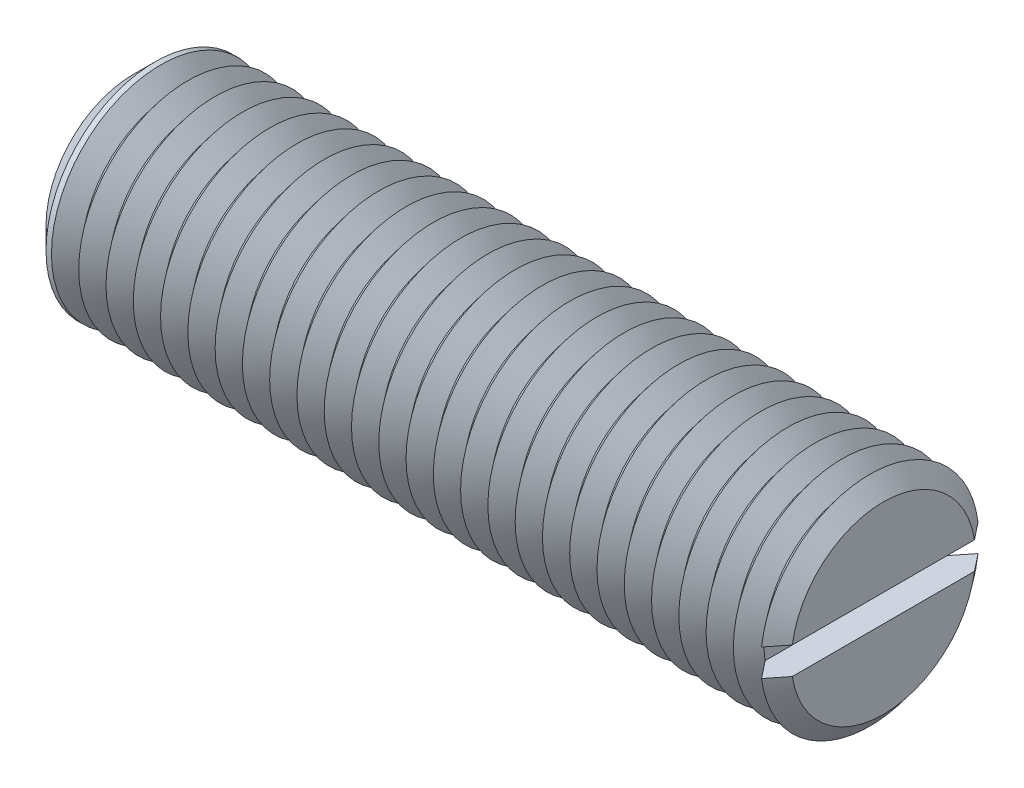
ISO-10303-21;
HEADER;
FILE_DESCRIPTION(('STEP AP214'),'2;1');
FILE_NAME('part.step','',(''),(''),'','','');
FILE_SCHEMA(('AUTOMOTIVE_DESIGN { 1 0 10303 214 1 1 1 1 }'));
ENDSEC;
DATA;
#1=APPLICATION_CONTEXT('core data for automotive mechanical design processes');
#2=APPLICATION_PROTOCOL_DEFINITION('international standard','automotive_design',2000,#1);
#3=PRODUCT_CONTEXT('',#1,'mechanical');
#4=PRODUCT('Part','Part','',(#3));
#5=PRODUCT_RELATED_PRODUCT_CATEGORY('part','',(#4));
#6=PRODUCT_DEFINITION_FORMATION('','',#4);
#7=PRODUCT_DEFINITION_CONTEXT('part definition',#1,'design');
#8=PRODUCT_DEFINITION('design','',#6,#7);
#9=PRODUCT_DEFINITION_SHAPE('','',#8);
#10=(LENGTH_UNIT() NAMED_UNIT(*) SI_UNIT(.MILLI.,.METRE.));
#11=(NAMED_UNIT(*) PLANE_ANGLE_UNIT() SI_UNIT($,.RADIAN.));
#12=(NAMED_UNIT(*) SI_UNIT($,.STERADIAN.) SOLID_ANGLE_UNIT());
#13=UNCERTAINTY_MEASURE_WITH_UNIT(LENGTH_MEASURE(1.E-05),#10,'distance_accuracy_value','');
#14=(GEOMETRIC_REPRESENTATION_CONTEXT(3) GLOBAL_UNCERTAINTY_ASSIGNED_CONTEXT((#13)) GLOBAL_UNIT_ASSIGNED_CONTEXT((#10,
#11,#12)) REPRESENTATION_CONTEXT('',''));
#15=CARTESIAN_POINT('',(0.,0.,0.));
#16=DIRECTION('',(0.,0.,1.));
#17=DIRECTION('',(1.,0.,0.));
#18=AXIS2_PLACEMENT_3D('',#15,#16,#17);
#19=CARTESIAN_POINT('',(26.5,0.,0.));
#20=DIRECTION('',(1.,0.,0.));
#21=DIRECTION('',(0.,0.,-1.));
#22=AXIS2_PLACEMENT_3D('',#19,#20,#21);
#23=CONICAL_SURFACE('',#22,8.,0.895664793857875);
#24=CARTESIAN_POINT('',(26.5,0.,0.));
#25=DIRECTION('',(-1.,0.,0.));
#26=DIRECTION('',(0.,0.,1.));
#27=AXIS2_PLACEMENT_3D('',#24,#25,#26);
#28=CIRCLE('',#27,8.);
#29=CARTESIAN_POINT('',(26.5,-1.,-7.93725393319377));
#30=VERTEX_POINT('',#29);
#31=CARTESIAN_POINT('',(26.5,-1.,7.93725393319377));
#32=VERTEX_POINT('',#31);
#33=EDGE_CURVE('E117',#30,#32,#28,.T.);
#34=ORIENTED_EDGE('',*,*,#33,.T.);
#35=CARTESIAN_POINT('',(34.1137872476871,-1.,-17.4810381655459));
#36=CARTESIAN_POINT('',(33.5731000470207,-1.,-16.8046018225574));
#37=CARTESIAN_POINT('',(33.0324624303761,-1.,-16.1281258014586));
#38=CARTESIAN_POINT('',(31.9513425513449,-1.,-14.7749910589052));
#39=CARTESIAN_POINT('',(31.4108602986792,-1.,-14.0983323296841));
#40=CARTESIAN_POINT('',(30.3295593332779,-1.,-12.7440423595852));
#41=CARTESIAN_POINT('',(29.7887409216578,-1.,-12.0664108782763));
#42=CARTESIAN_POINT('',(28.7075665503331,-1.,-10.7108366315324));
#43=CARTESIAN_POINT('',(28.1672105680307,-1.,-10.0328938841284));
#44=CARTESIAN_POINT('',(27.3866021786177,-1.,-9.05235403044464));
#45=CARTESIAN_POINT('',(27.1460332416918,-1.,-8.75000893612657));
#46=CARTESIAN_POINT('',(26.6651110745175,-1.,-8.14514467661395));
#47=CARTESIAN_POINT('',(26.4247578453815,-1.,-7.84262551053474));
#48=CARTESIAN_POINT('',(25.9443170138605,-1.,-7.23730074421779));
#49=CARTESIAN_POINT('',(25.7042294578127,-1.,-6.93449510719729));
#50=CARTESIAN_POINT('',(25.2244992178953,-1.,-6.32854042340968));
#51=CARTESIAN_POINT('',(24.9848565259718,-1.,-6.02539138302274));
#52=CARTESIAN_POINT('',(24.5064209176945,-1.,-5.41876829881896));
#53=CARTESIAN_POINT('',(24.2676275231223,-1.,-5.11529463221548));
#54=CARTESIAN_POINT('',(23.791132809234,-1.,-4.50745556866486));
#55=CARTESIAN_POINT('',(23.5534315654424,-1.,-4.20309011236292));
#56=CARTESIAN_POINT('',(23.1984723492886,-1.,-3.74537358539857));
#57=CARTESIAN_POINT('',(23.080434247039,-1.,-3.59262786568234));
#58=CARTESIAN_POINT('',(22.8451171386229,-1.,-3.28655323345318));
#59=CARTESIAN_POINT('',(22.7278381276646,-1.,-3.13322432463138));
#60=CARTESIAN_POINT('',(22.4944317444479,-1.,-2.82571819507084));
#61=CARTESIAN_POINT('',(22.3783042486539,-1.,-2.67154106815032));
#62=CARTESIAN_POINT('',(22.1478553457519,-1.,-2.36184450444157));
#63=CARTESIAN_POINT('',(22.0335338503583,-1.,-2.20632513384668));
#64=CARTESIAN_POINT('',(21.8956998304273,-1.,-2.01476175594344));
#65=CARTESIAN_POINT('',(21.8706709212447,-1.,-1.97980928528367));
#66=CARTESIAN_POINT('',(21.8208007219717,-1.,-1.90977040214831));
#67=CARTESIAN_POINT('',(21.7959594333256,-1.,-1.87468398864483));
#68=CARTESIAN_POINT('',(21.7217527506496,-1.,-1.76919140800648));
#69=CARTESIAN_POINT('',(21.6727089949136,-1.,-1.69855807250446));
#70=CARTESIAN_POINT('',(21.5751159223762,-1.,-1.55549554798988));
#71=CARTESIAN_POINT('',(21.5265831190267,-1.,-1.48305505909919));
#72=CARTESIAN_POINT('',(21.4312399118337,-1.,-1.33706835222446));
#73=CARTESIAN_POINT('',(21.3844290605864,-1.,-1.26352242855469));
#74=CARTESIAN_POINT('',(21.2926759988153,-1.,-1.1137948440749));
#75=CARTESIAN_POINT('',(21.2477706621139,-1.,-1.03759043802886));
#76=CARTESIAN_POINT('',(21.161907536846,-1.,-0.882780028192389));
#77=CARTESIAN_POINT('',(21.1209558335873,-1.,-0.804170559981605));
#78=CARTESIAN_POINT('',(21.06478469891,-1.,-0.684500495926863));
#79=CARTESIAN_POINT('',(21.0470539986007,-1.,-0.644631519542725));
#80=CARTESIAN_POINT('',(21.0136729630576,-1.,-0.564036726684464));
#81=CARTESIAN_POINT('',(20.9980230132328,-1.,-0.523310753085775));
#82=CARTESIAN_POINT('',(20.9551526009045,-1.,-0.399956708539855));
#83=CARTESIAN_POINT('',(20.9318433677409,-1.,-0.315816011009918));
#84=CARTESIAN_POINT('',(20.9098657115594,-1.,-0.193542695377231));
#85=CARTESIAN_POINT('',(20.9047261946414,-1.,-0.156548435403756));
#86=CARTESIAN_POINT('',(20.8976757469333,-1.,-0.0822397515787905));
#87=CARTESIAN_POINT('',(20.8957650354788,-1.,-0.0449253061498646));
#88=CARTESIAN_POINT('',(20.8953106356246,-1.,0.029693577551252));
#89=CARTESIAN_POINT('',(20.8967642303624,-1.,0.0669979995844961));
#90=CARTESIAN_POINT('',(20.902929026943,-1.,0.141334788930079));
#91=CARTESIAN_POINT('',(20.9076406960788,-1.,0.178367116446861));
#92=CARTESIAN_POINT('',(20.9224195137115,-1.,0.266117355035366));
#93=CARTESIAN_POINT('',(20.9338513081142,-1.,0.316604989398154));
#94=CARTESIAN_POINT('',(20.961310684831,-1.,0.416309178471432));
#95=CARTESIAN_POINT('',(20.9773414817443,-1.,0.465524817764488));
#96=CARTESIAN_POINT('',(21.0130409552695,-1.,0.563049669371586));
#97=CARTESIAN_POINT('',(21.0327381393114,-1.,0.611348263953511));
#98=CARTESIAN_POINT('',(21.0747706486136,-1.,0.70674880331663));
#99=CARTESIAN_POINT('',(21.0971051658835,-1.,0.753851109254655));
#100=CARTESIAN_POINT('',(21.1464135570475,-1.,0.852405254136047));
#101=CARTESIAN_POINT('',(21.1736257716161,-1.,0.903736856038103));
#102=CARTESIAN_POINT('',(21.2298407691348,-1.,1.00541472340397));
#103=CARTESIAN_POINT('',(21.2588439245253,-1.,1.05576078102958));
#104=CARTESIAN_POINT('',(21.3478642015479,-1.,1.20570300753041));
#105=CARTESIAN_POINT('',(21.409851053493,-1.,1.30412495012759));
#106=CARTESIAN_POINT('',(21.5370218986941,-1.,1.49921478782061));
#107=CARTESIAN_POINT('',(21.6022138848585,-1.,1.59587737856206));
#108=CARTESIAN_POINT('',(21.734509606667,-1.,1.78781770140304));
#109=CARTESIAN_POINT('',(21.8016124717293,-1.,1.88309603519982));
#110=CARTESIAN_POINT('',(21.9371969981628,-1.,2.07285006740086));
#111=CARTESIAN_POINT('',(22.0056803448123,-1.,2.16732455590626));
#112=CARTESIAN_POINT('',(22.1435598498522,-1.,2.3556198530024));
#113=CARTESIAN_POINT('',(22.2129561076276,-1.,2.44944058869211));
#114=CARTESIAN_POINT('',(22.3522867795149,-1.,2.63643541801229));
#115=CARTESIAN_POINT('',(22.4222200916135,-1.,2.72961033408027));
#116=CARTESIAN_POINT('',(22.5625737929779,-1.,2.9155867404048));
#117=CARTESIAN_POINT('',(22.6329941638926,-1.,3.00838824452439));
#118=CARTESIAN_POINT('',(22.8434401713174,-1.,3.2845708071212));
#119=CARTESIAN_POINT('',(22.9840068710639,-1.,3.46753938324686));
#120=CARTESIAN_POINT('',(23.266047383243,-1.,3.832776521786));
#121=CARTESIAN_POINT('',(23.4075212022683,-1.,4.01504507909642));
#122=CARTESIAN_POINT('',(23.8328445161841,-1.,4.56116633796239));
#123=CARTESIAN_POINT('',(24.1175870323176,-1.,4.92432312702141));
#124=CARTESIAN_POINT('',(24.688450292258,-1.,5.64994266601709));
#125=CARTESIAN_POINT('',(24.9745718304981,-1.,6.01240478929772));
#126=CARTESIAN_POINT('',(25.5475166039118,-1.,6.73676512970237));
#127=CARTESIAN_POINT('',(25.834339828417,-1.,7.09866335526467));
#128=CARTESIAN_POINT('',(26.4076446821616,-1.,7.82112227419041));
#129=CARTESIAN_POINT('',(26.6941251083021,-1.,8.18168392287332));
#130=CARTESIAN_POINT('',(27.2673842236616,-1.,8.90257236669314));
#131=CARTESIAN_POINT('',(27.5541629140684,-1.,9.26289916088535));
#132=CARTESIAN_POINT('',(28.4146958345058,-1.,10.3434977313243));
#133=CARTESIAN_POINT('',(28.9887564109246,-1.,11.0635255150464));
#134=CARTESIAN_POINT('',(29.9416309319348,-1.,12.2579358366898));
#135=CARTESIAN_POINT('',(30.3203198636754,-1.,12.7324181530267));
#136=CARTESIAN_POINT('',(31.077860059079,-1.,13.6812951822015));
#137=CARTESIAN_POINT('',(31.4567113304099,-1.,14.1556898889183));
#138=CARTESIAN_POINT('',(32.2152320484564,-1.,15.1052923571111));
#139=CARTESIAN_POINT('',(32.5949016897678,-1.,15.5804999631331));
#140=CARTESIAN_POINT('',(33.3543004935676,-1.,16.5308253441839));
#141=CARTESIAN_POINT('',(33.7340296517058,-1.,17.005943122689));
#142=CARTESIAN_POINT('',(34.1137872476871,-1.,17.4810381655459));
#143=B_SPLINE_CURVE_WITH_KNOTS('',3,(#35,#36,#37,#38,#39,#40,#41,#42,#43,#44,#45,#46,#47,#48,
#49,#50,#51,#52,#53,#54,#55,#56,#57,#58,#59,#60,#61,#62,#63,#64,#65,#66,#67,#68,#69,#70,#71,#72,
#73,#74,#75,#76,#77,#78,#79,#80,#81,#82,#83,#84,#85,#86,#87,#88,#89,#90,#91,#92,#93,#94,#95,#96,
#97,#98,#99,#100,#101,#102,#103,#104,#105,#106,#107,#108,#109,#110,#111,#112,#113,#114,#115,
#116,#117,#118,#119,#120,#121,#122,#123,#124,#125,#126,#127,#128,#129,#130,#131,#132,#133,#134,
#135,#136,#137,#138,#139,#140,#141,#142),.UNSPECIFIED.,.F.,.F.,(4,2,2,2,2,2,2,2,2,2,2,2,2,2,2,2,
2,2,2,2,2,2,2,2,2,2,2,2,2,2,2,2,2,2,2,2,2,2,2,2,2,2,2,2,2,2,2,2,2,2,2,2,2,4),(0.,
2.59791825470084,5.19597381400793,7.79693910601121,10.3977690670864,11.5568952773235,
12.7160274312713,13.8753371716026,15.0346257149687,16.1931009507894,17.3516551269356,
17.9307722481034,18.5098857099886,19.0889363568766,19.6679586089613,19.7969273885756,
19.9258971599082,20.1838595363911,20.4454304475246,20.7069329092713,20.9722220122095,
21.2379131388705,21.3687577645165,21.4996265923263,21.760240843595,21.8721711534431,
21.9841090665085,22.0959566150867,22.2078202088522,22.3628274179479,22.5179432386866,
22.6743197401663,22.8306484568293,23.0048946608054,23.1791772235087,23.5280071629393,
23.8777561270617,24.2273482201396,24.5773965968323,24.927483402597,25.2769811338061,
25.6264657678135,26.3186514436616,27.0108421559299,28.3952670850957,29.7806179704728,
31.1659479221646,32.5474981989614,33.9290539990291,36.6916375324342,38.5128593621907,
40.334179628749,42.1589376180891,43.9835965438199),.UNSPECIFIED.);
#144=CARTESIAN_POINT('',(25.5,-1.,6.67652652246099));
#145=VERTEX_POINT('',#144);
#146=EDGE_CURVE('E109',#145,#32,#143,.T.);
#147=ORIENTED_EDGE('',*,*,#146,.F.);
#148=CARTESIAN_POINT('',(25.5,0.,0.));
#149=DIRECTION('',(-1.,0.,0.));
#150=DIRECTION('',(0.,0.,1.));
#151=AXIS2_PLACEMENT_3D('',#148,#149,#150);
#152=CIRCLE('',#151,6.75100040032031);
#153=CARTESIAN_POINT('',(25.5,-1.,-6.67652652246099));
#154=VERTEX_POINT('',#153);
#155=EDGE_CURVE('E431',#154,#145,#152,.T.);
#156=ORIENTED_EDGE('',*,*,#155,.F.);
#157=EDGE_CURVE('E58',#30,#154,#143,.T.);
#158=ORIENTED_EDGE('',*,*,#157,.F.);
#159=EDGE_LOOP('',(#34,#147,#156,#158));
#160=FACE_BOUND('',#159,.T.);
#161=ADVANCED_FACE('F37',(#160),#23,.T.);
#162=CARTESIAN_POINT('',(26.5,1.,7.93725393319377));
#163=VERTEX_POINT('',#162);
#164=CARTESIAN_POINT('',(26.5,1.,-7.93725393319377));
#165=VERTEX_POINT('',#164);
#166=EDGE_CURVE('E100',#163,#165,#28,.T.);
#167=ORIENTED_EDGE('',*,*,#166,.T.);
#168=CARTESIAN_POINT('',(34.1137872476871,1.,17.4810381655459));
#169=CARTESIAN_POINT('',(33.5731000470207,1.,16.8046018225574));
#170=CARTESIAN_POINT('',(33.0324624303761,1.,16.1281258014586));
#171=CARTESIAN_POINT('',(31.9513425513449,1.,14.7749910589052));
#172=CARTESIAN_POINT('',(31.4108602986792,1.,14.0983323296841));
#173=CARTESIAN_POINT('',(30.3295593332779,1.,12.7440423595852));
#174=CARTESIAN_POINT('',(29.7887409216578,1.,12.0664108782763));
#175=CARTESIAN_POINT('',(28.7075665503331,1.,10.7108366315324));
#176=CARTESIAN_POINT('',(28.1672105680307,1.,10.0328938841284));
#177=CARTESIAN_POINT('',(27.3866021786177,1.,9.05235403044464));
#178=CARTESIAN_POINT('',(27.1460332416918,1.,8.75000893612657));
#179=CARTESIAN_POINT('',(26.6651110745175,1.,8.14514467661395));
#180=CARTESIAN_POINT('',(26.4247578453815,1.,7.84262551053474));
#181=CARTESIAN_POINT('',(25.9443170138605,1.,7.23730074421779));
#182=CARTESIAN_POINT('',(25.7042294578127,1.,6.93449510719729));
#183=CARTESIAN_POINT('',(25.2244992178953,1.,6.32854042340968));
#184=CARTESIAN_POINT('',(24.9848565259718,1.,6.02539138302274));
#185=CARTESIAN_POINT('',(24.5064209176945,1.,5.41876829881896));
#186=CARTESIAN_POINT('',(24.2676275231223,1.,5.11529463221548));
#187=CARTESIAN_POINT('',(23.791132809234,1.,4.50745556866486));
#188=CARTESIAN_POINT('',(23.5534315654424,1.,4.20309011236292));
#189=CARTESIAN_POINT('',(23.1984723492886,1.,3.74537358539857));
#190=CARTESIAN_POINT('',(23.080434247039,1.,3.59262786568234));
#191=CARTESIAN_POINT('',(22.8451171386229,1.,3.28655323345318));
#192=CARTESIAN_POINT('',(22.7278381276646,1.,3.13322432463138));
#193=CARTESIAN_POINT('',(22.4944317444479,1.,2.82571819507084));
#194=CARTESIAN_POINT('',(22.3783042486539,1.,2.67154106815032));
#195=CARTESIAN_POINT('',(22.1478553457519,1.,2.36184450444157));
#196=CARTESIAN_POINT('',(22.0335338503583,1.,2.20632513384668));
#197=CARTESIAN_POINT('',(21.8956998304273,1.,2.01476175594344));
#198=CARTESIAN_POINT('',(21.8706709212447,1.,1.97980928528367));
#199=CARTESIAN_POINT('',(21.8208007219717,1.,1.90977040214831));
#200=CARTESIAN_POINT('',(21.7959594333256,1.,1.87468398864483));
#201=CARTESIAN_POINT('',(21.7217527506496,1.,1.76919140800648));
#202=CARTESIAN_POINT('',(21.6727089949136,1.,1.69855807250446));
#203=CARTESIAN_POINT('',(21.5751159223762,1.,1.55549554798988));
#204=CARTESIAN_POINT('',(21.5265831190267,1.,1.48305505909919));
#205=CARTESIAN_POINT('',(21.4312399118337,1.,1.33706835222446));
#206=CARTESIAN_POINT('',(21.3844290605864,1.,1.26352242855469));
#207=CARTESIAN_POINT('',(21.2926759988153,1.,1.1137948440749));
#208=CARTESIAN_POINT('',(21.2477706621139,1.,1.03759043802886));
#209=CARTESIAN_POINT('',(21.161907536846,1.,0.882780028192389));
#210=CARTESIAN_POINT('',(21.1209558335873,1.,0.804170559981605));
#211=CARTESIAN_POINT('',(21.06478469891,1.,0.684500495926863));
#212=CARTESIAN_POINT('',(21.0470539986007,1.,0.644631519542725));
#213=CARTESIAN_POINT('',(21.0136729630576,1.,0.564036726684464));
#214=CARTESIAN_POINT('',(20.9980230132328,1.,0.523310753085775));
#215=CARTESIAN_POINT('',(20.9551526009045,1.,0.399956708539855));
#216=CARTESIAN_POINT('',(20.9318433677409,1.,0.315816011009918));
#217=CARTESIAN_POINT('',(20.9098657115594,1.,0.193542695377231));
#218=CARTESIAN_POINT('',(20.9047261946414,1.,0.156548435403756));
#219=CARTESIAN_POINT('',(20.8976757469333,1.,0.0822397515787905));
#220=CARTESIAN_POINT('',(20.8957650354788,1.,0.0449253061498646));
#221=CARTESIAN_POINT('',(20.8953106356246,1.,-0.029693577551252));
#222=CARTESIAN_POINT('',(20.8967642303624,1.,-0.0669979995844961));
#223=CARTESIAN_POINT('',(20.902929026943,1.,-0.141334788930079));
#224=CARTESIAN_POINT('',(20.9076406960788,1.,-0.178367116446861));
#225=CARTESIAN_POINT('',(20.9224195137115,1.,-0.266117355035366));
#226=CARTESIAN_POINT('',(20.9338513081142,1.,-0.316604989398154));
#227=CARTESIAN_POINT('',(20.961310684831,1.,-0.416309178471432));
#228=CARTESIAN_POINT('',(20.9773414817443,1.,-0.465524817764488));
#229=CARTESIAN_POINT('',(21.0130409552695,1.,-0.563049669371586));
#230=CARTESIAN_POINT('',(21.0327381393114,1.,-0.611348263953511));
#231=CARTESIAN_POINT('',(21.0747706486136,1.,-0.70674880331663));
#232=CARTESIAN_POINT('',(21.0971051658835,1.,-0.753851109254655));
#233=CARTESIAN_POINT('',(21.1464135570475,1.,-0.852405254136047));
#234=CARTESIAN_POINT('',(21.1736257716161,1.,-0.903736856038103));
#235=CARTESIAN_POINT('',(21.2298407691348,1.,-1.00541472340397));
#236=CARTESIAN_POINT('',(21.2588439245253,1.,-1.05576078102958));
#237=CARTESIAN_POINT('',(21.3478642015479,1.,-1.20570300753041));
#238=CARTESIAN_POINT('',(21.409851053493,1.,-1.30412495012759));
#239=CARTESIAN_POINT('',(21.5370218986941,1.,-1.49921478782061));
#240=CARTESIAN_POINT('',(21.6022138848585,1.,-1.59587737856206));
#241=CARTESIAN_POINT('',(21.734509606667,1.,-1.78781770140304));
#242=CARTESIAN_POINT('',(21.8016124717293,1.,-1.88309603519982));
#243=CARTESIAN_POINT('',(21.9371969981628,1.,-2.07285006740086));
#244=CARTESIAN_POINT('',(22.0056803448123,1.,-2.16732455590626));
#245=CARTESIAN_POINT('',(22.1435598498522,1.,-2.3556198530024));
#246=CARTESIAN_POINT('',(22.2129561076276,1.,-2.44944058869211));
#247=CARTESIAN_POINT('',(22.3522867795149,1.,-2.63643541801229));
#248=CARTESIAN_POINT('',(22.4222200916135,1.,-2.72961033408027));
#249=CARTESIAN_POINT('',(22.5625737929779,1.,-2.9155867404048));
#250=CARTESIAN_POINT('',(22.6329941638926,1.,-3.00838824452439));
#251=CARTESIAN_POINT('',(22.8434401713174,1.,-3.2845708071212));
#252=CARTESIAN_POINT('',(22.9840068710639,1.,-3.46753938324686));
#253=CARTESIAN_POINT('',(23.266047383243,1.,-3.832776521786));
#254=CARTESIAN_POINT('',(23.4075212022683,1.,-4.01504507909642));
#255=CARTESIAN_POINT('',(23.8328445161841,1.,-4.56116633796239));
#256=CARTESIAN_POINT('',(24.1175870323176,1.,-4.92432312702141));
#257=CARTESIAN_POINT('',(24.688450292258,1.,-5.64994266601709));
#258=CARTESIAN_POINT('',(24.9745718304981,1.,-6.01240478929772));
#259=CARTESIAN_POINT('',(25.5475166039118,1.,-6.73676512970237));
#260=CARTESIAN_POINT('',(25.834339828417,1.,-7.09866335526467));
#261=CARTESIAN_POINT('',(26.4076446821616,1.,-7.82112227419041));
#262=CARTESIAN_POINT('',(26.6941251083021,1.,-8.18168392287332));
#263=CARTESIAN_POINT('',(27.2673842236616,1.,-8.90257236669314));
#264=CARTESIAN_POINT('',(27.5541629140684,1.,-9.26289916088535));
#265=CARTESIAN_POINT('',(28.4146958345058,1.,-10.3434977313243));
#266=CARTESIAN_POINT('',(28.9887564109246,1.,-11.0635255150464));
#267=CARTESIAN_POINT('',(29.9416309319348,1.,-12.2579358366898));
#268=CARTESIAN_POINT('',(30.3203198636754,1.,-12.7324181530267));
#269=CARTESIAN_POINT('',(31.077860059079,1.,-13.6812951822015));
#270=CARTESIAN_POINT('',(31.4567113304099,1.,-14.1556898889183));
#271=CARTESIAN_POINT('',(32.2152320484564,1.,-15.1052923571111));
#272=CARTESIAN_POINT('',(32.5949016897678,1.,-15.5804999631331));
#273=CARTESIAN_POINT('',(33.3543004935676,1.,-16.5308253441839));
#274=CARTESIAN_POINT('',(33.7340296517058,1.,-17.005943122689));
#275=CARTESIAN_POINT('',(34.1137872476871,1.,-17.4810381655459));
#276=B_SPLINE_CURVE_WITH_KNOTS('',3,(#168,#169,#170,#171,#172,#173,#174,#175,#176,#177,#178,
#179,#180,#181,#182,#183,#184,#185,#186,#187,#188,#189,#190,#191,#192,#193,#194,#195,#196,#197,
#198,#199,#200,#201,#202,#203,#204,#205,#206,#207,#208,#209,#210,#211,#212,#213,#214,#215,#216,
#217,#218,#219,#220,#221,#222,#223,#224,#225,#226,#227,#228,#229,#230,#231,#232,#233,#234,#235,
#236,#237,#238,#239,#240,#241,#242,#243,#244,#245,#246,#247,#248,#249,#250,#251,#252,#253,#254,
#255,#256,#257,#258,#259,#260,#261,#262,#263,#264,#265,#266,#267,#268,#269,#270,#271,#272,#273,
#274,#275),.UNSPECIFIED.,.F.,.F.,(4,2,2,2,2,2,2,2,2,2,2,2,2,2,2,2,2,2,2,2,2,2,2,2,2,2,2,2,2,2,2,
2,2,2,2,2,2,2,2,2,2,2,2,2,2,2,2,2,2,2,2,2,2,4),(0.,2.59791825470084,5.19597381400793,
7.79693910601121,10.3977690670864,11.5568952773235,12.7160274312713,13.8753371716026,
15.0346257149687,16.1931009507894,17.3516551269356,17.9307722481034,18.5098857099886,
19.0889363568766,19.6679586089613,19.7969273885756,19.9258971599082,20.1838595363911,
20.4454304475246,20.7069329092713,20.9722220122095,21.2379131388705,21.3687577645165,
21.4996265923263,21.760240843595,21.8721711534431,21.9841090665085,22.0959566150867,
22.2078202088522,22.3628274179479,22.5179432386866,22.6743197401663,22.8306484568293,
23.0048946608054,23.1791772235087,23.5280071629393,23.8777561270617,24.2273482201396,
24.5773965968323,24.927483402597,25.2769811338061,25.6264657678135,26.3186514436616,
27.0108421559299,28.3952670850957,29.7806179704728,31.1659479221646,32.5474981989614,
33.9290539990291,36.6916375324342,38.5128593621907,40.334179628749,42.1589376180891,
43.9835965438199),.UNSPECIFIED.);
#277=CARTESIAN_POINT('',(25.5,1.,-6.67652652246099));
#278=VERTEX_POINT('',#277);
#279=EDGE_CURVE('E110',#278,#165,#276,.T.);
#280=ORIENTED_EDGE('',*,*,#279,.F.);
#281=CARTESIAN_POINT('',(25.5,1.,6.67652652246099));
#282=VERTEX_POINT('',#281);
#283=EDGE_CURVE('E103',#282,#278,#152,.T.);
#284=ORIENTED_EDGE('',*,*,#283,.F.);
#285=EDGE_CURVE('E97',#163,#282,#276,.T.);
#286=ORIENTED_EDGE('',*,*,#285,.F.);
#287=EDGE_LOOP('',(#167,#280,#284,#286));
#288=FACE_BOUND('',#287,.T.);
#289=ADVANCED_FACE('F99',(#288),#23,.T.);
#290=CARTESIAN_POINT('',(25.5,0.,0.));
#291=DIRECTION('',(-1.,0.,0.));
#292=DIRECTION('',(0.,0.,1.));
#293=AXIS2_PLACEMENT_3D('',#290,#291,#292);
#294=CONICAL_SURFACE('',#293,6.75100040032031,0.895664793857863);
#295=CARTESIAN_POINT('',(24.5,0.,0.));
#296=DIRECTION('',(-1.,0.,0.));
#297=DIRECTION('',(0.,0.,1.));
#298=AXIS2_PLACEMENT_3D('',#295,#296,#297);
#299=CIRCLE('',#298,8.);
#300=CARTESIAN_POINT('',(24.5,0.,8.));
#301=VERTEX_POINT('',#300);
#302=EDGE_CURVE('E417',#301,#301,#299,.T.);
#303=ORIENTED_EDGE('',*,*,#302,.F.);
#304=EDGE_LOOP('',(#303));
#305=FACE_BOUND('',#304,.T.);
#306=ORIENTED_EDGE('',*,*,#283,.T.);
#307=EDGE_CURVE('E425',#278,#154,#152,.T.);
#308=ORIENTED_EDGE('',*,*,#307,.T.);
#309=ORIENTED_EDGE('',*,*,#155,.T.);
#310=EDGE_CURVE('E423',#145,#282,#152,.T.);
#311=ORIENTED_EDGE('',*,*,#310,.T.);
#312=EDGE_LOOP('',(#306,#308,#309,#311));
#313=FACE_BOUND('',#312,.T.);
#314=ADVANCED_FACE('F167',(#305,#313),#294,.T.);
#315=CARTESIAN_POINT('',(27.5,0.,0.));
#316=DIRECTION('',(1.,0.,0.));
#317=DIRECTION('',(0.,0.,-1.));
#318=AXIS2_PLACEMENT_3D('',#315,#316,#317);
#319=PLANE('',#318);
#320=CARTESIAN_POINT('',(27.5,0.,0.));
#321=DIRECTION('',(-1.,0.,0.));
#322=DIRECTION('',(0.,0.,1.));
#323=AXIS2_PLACEMENT_3D('',#320,#321,#322);
#324=CIRCLE('',#323,6.75100040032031);
#325=CARTESIAN_POINT('',(27.5,1.,6.67652652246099));
#326=VERTEX_POINT('',#325);
#327=CARTESIAN_POINT('',(27.5,1.,-6.67652652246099));
#328=VERTEX_POINT('',#327);
#329=EDGE_CURVE('E159',#326,#328,#324,.T.);
#330=ORIENTED_EDGE('',*,*,#329,.F.);
#331=DIRECTION('',(0.,0.,1.));
#332=VECTOR('',#331,1.);
#333=CARTESIAN_POINT('',(27.5,1.,0.));
#334=LINE('',#333,#332);
#335=EDGE_CURVE('E122',#328,#326,#334,.T.);
#336=ORIENTED_EDGE('',*,*,#335,.F.);
#337=EDGE_LOOP('',(#330,#336));
#338=FACE_BOUND('',#337,.T.);
#339=ADVANCED_FACE('F171',(#338),#319,.T.);
#340=CARTESIAN_POINT('',(27.5,-1.,-6.67652652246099));
#341=VERTEX_POINT('',#340);
#342=CARTESIAN_POINT('',(27.5,-1.,6.67652652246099));
#343=VERTEX_POINT('',#342);
#344=EDGE_CURVE('E66',#341,#343,#324,.T.);
#345=ORIENTED_EDGE('',*,*,#344,.F.);
#346=DIRECTION('',(0.,0.,-1.));
#347=VECTOR('',#346,1.);
#348=CARTESIAN_POINT('',(27.5,-1.,0.));
#349=LINE('',#348,#347);
#350=EDGE_CURVE('E135',#343,#341,#349,.T.);
#351=ORIENTED_EDGE('',*,*,#350,.F.);
#352=EDGE_LOOP('',(#345,#351));
#353=FACE_BOUND('',#352,.T.);
#354=ADVANCED_FACE('F202',(#353),#319,.T.);
#355=CARTESIAN_POINT('',(27.5,0.,0.));
#356=DIRECTION('',(-1.,0.,0.));
#357=DIRECTION('',(0.,0.,1.));
#358=AXIS2_PLACEMENT_3D('',#355,#356,#357);
#359=CONICAL_SURFACE('',#358,6.75100040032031,0.895664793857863);
#360=ORIENTED_EDGE('',*,*,#166,.F.);
#361=CARTESIAN_POINT('',(18.8862127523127,1.,-17.4810381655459));
#362=CARTESIAN_POINT('',(19.4268999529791,1.,-16.8046018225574));
#363=CARTESIAN_POINT('',(19.9675375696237,1.,-16.1281258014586));
#364=CARTESIAN_POINT('',(21.0486574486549,1.,-14.7749910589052));
#365=CARTESIAN_POINT('',(21.5891397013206,1.,-14.0983323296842));
#366=CARTESIAN_POINT('',(22.6704406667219,1.,-12.7440423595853));
#367=CARTESIAN_POINT('',(23.211259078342,1.,-12.0664108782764));
#368=CARTESIAN_POINT('',(24.2924334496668,1.,-10.7108366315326));
#369=CARTESIAN_POINT('',(24.8327894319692,1.,-10.0328938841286));
#370=CARTESIAN_POINT('',(25.6133978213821,1.,-9.05235403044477));
#371=CARTESIAN_POINT('',(25.8539667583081,1.,-8.75000893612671));
#372=CARTESIAN_POINT('',(26.3348889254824,1.,-8.14514467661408));
#373=CARTESIAN_POINT('',(26.5752421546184,1.,-7.84262551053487));
#374=CARTESIAN_POINT('',(27.0556829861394,1.,-7.23730074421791));
#375=CARTESIAN_POINT('',(27.2957705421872,1.,-6.93449510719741));
#376=CARTESIAN_POINT('',(27.7755007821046,1.,-6.32854042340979));
#377=CARTESIAN_POINT('',(28.0151434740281,1.,-6.02539138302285));
#378=CARTESIAN_POINT('',(28.4935790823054,1.,-5.41876829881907));
#379=CARTESIAN_POINT('',(28.7323724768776,1.,-5.11529463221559));
#380=CARTESIAN_POINT('',(29.208867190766,1.,-4.50745556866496));
#381=CARTESIAN_POINT('',(29.4465684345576,1.,-4.20309011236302));
#382=CARTESIAN_POINT('',(29.8015276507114,1.,-3.74537358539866));
#383=CARTESIAN_POINT('',(29.919565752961,1.,-3.59262786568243));
#384=CARTESIAN_POINT('',(30.1548828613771,1.,-3.28655323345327));
#385=CARTESIAN_POINT('',(30.2721618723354,1.,-3.13322432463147));
#386=CARTESIAN_POINT('',(30.5055682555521,1.,-2.82571819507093));
#387=CARTESIAN_POINT('',(30.6216957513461,1.,-2.67154106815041));
#388=CARTESIAN_POINT('',(30.8521446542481,1.,-2.36184450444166));
#389=CARTESIAN_POINT('',(30.9664661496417,1.,-2.20632513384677));
#390=CARTESIAN_POINT('',(31.1043001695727,1.,-2.01476175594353));
#391=CARTESIAN_POINT('',(31.1293290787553,1.,-1.97980928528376));
#392=CARTESIAN_POINT('',(31.1791992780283,1.,-1.90977040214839));
#393=CARTESIAN_POINT('',(31.2040405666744,1.,-1.87468398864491));
#394=CARTESIAN_POINT('',(31.2782472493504,1.,-1.76919140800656));
#395=CARTESIAN_POINT('',(31.3272910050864,1.,-1.69855807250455));
#396=CARTESIAN_POINT('',(31.4248840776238,1.,-1.55549554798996));
#397=CARTESIAN_POINT('',(31.4734168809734,1.,-1.48305505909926));
#398=CARTESIAN_POINT('',(31.5687600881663,1.,-1.33706835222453));
#399=CARTESIAN_POINT('',(31.6155709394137,1.,-1.26352242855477));
#400=CARTESIAN_POINT('',(31.7073240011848,1.,-1.11379484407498));
#401=CARTESIAN_POINT('',(31.7522293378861,1.,-1.03759043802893));
#402=CARTESIAN_POINT('',(31.838092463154,1.,-0.882780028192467));
#403=CARTESIAN_POINT('',(31.8790441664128,1.,-0.804170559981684));
#404=CARTESIAN_POINT('',(31.9352153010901,1.,-0.684500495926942));
#405=CARTESIAN_POINT('',(31.9529460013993,1.,-0.644631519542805));
#406=CARTESIAN_POINT('',(31.9863270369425,1.,-0.564036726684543));
#407=CARTESIAN_POINT('',(32.0019769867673,1.,-0.523310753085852));
#408=CARTESIAN_POINT('',(32.0448473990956,1.,-0.39995670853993));
#409=CARTESIAN_POINT('',(32.0681566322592,1.,-0.31581601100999));
#410=CARTESIAN_POINT('',(32.0901342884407,1.,-0.193542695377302));
#411=CARTESIAN_POINT('',(32.0952738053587,1.,-0.156548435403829));
#412=CARTESIAN_POINT('',(32.1023242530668,1.,-0.0822397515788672));
#413=CARTESIAN_POINT('',(32.1042349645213,1.,-0.0449253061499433));
#414=CARTESIAN_POINT('',(32.1046893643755,1.,0.0296935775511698));
#415=CARTESIAN_POINT('',(32.1032357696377,1.,0.0669979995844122));
#416=CARTESIAN_POINT('',(32.0970709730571,1.,0.141334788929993));
#417=CARTESIAN_POINT('',(32.0923593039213,1.,0.178367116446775));
#418=CARTESIAN_POINT('',(32.0775804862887,1.,0.266117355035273));
#419=CARTESIAN_POINT('',(32.0661486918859,1.,0.316604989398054));
#420=CARTESIAN_POINT('',(32.0386893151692,1.,0.416309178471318));
#421=CARTESIAN_POINT('',(32.0226585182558,1.,0.465524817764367));
#422=CARTESIAN_POINT('',(31.9869590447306,1.,0.563049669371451));
#423=CARTESIAN_POINT('',(31.9672618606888,1.,0.611348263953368));
#424=CARTESIAN_POINT('',(31.9252293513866,1.,0.706748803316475));
#425=CARTESIAN_POINT('',(31.9028948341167,1.,0.753851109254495));
#426=CARTESIAN_POINT('',(31.8535864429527,1.,0.852405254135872));
#427=CARTESIAN_POINT('',(31.8263742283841,1.,0.903736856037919));
#428=CARTESIAN_POINT('',(31.7701592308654,1.,1.00541472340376));
#429=CARTESIAN_POINT('',(31.7411560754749,1.,1.05576078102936));
#430=CARTESIAN_POINT('',(31.6521357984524,1.,1.20570300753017));
#431=CARTESIAN_POINT('',(31.5901489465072,1.,1.30412495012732));
#432=CARTESIAN_POINT('',(31.4629781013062,1.,1.49921478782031));
#433=CARTESIAN_POINT('',(31.3977861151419,1.,1.59587737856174));
#434=CARTESIAN_POINT('',(31.2654903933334,1.,1.78781770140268));
#435=CARTESIAN_POINT('',(31.198387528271,1.,1.88309603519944));
#436=CARTESIAN_POINT('',(31.0628030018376,1.,2.07285006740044));
#437=CARTESIAN_POINT('',(30.9943196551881,1.,2.16732455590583));
#438=CARTESIAN_POINT('',(30.8564401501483,1.,2.35561985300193));
#439=CARTESIAN_POINT('',(30.7870438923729,1.,2.44944058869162));
#440=CARTESIAN_POINT('',(30.6477132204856,1.,2.63643541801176));
#441=CARTESIAN_POINT('',(30.577779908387,1.,2.72961033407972));
#442=CARTESIAN_POINT('',(30.4374262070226,1.,2.91558674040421));
#443=CARTESIAN_POINT('',(30.3670058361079,1.,3.00838824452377));
#444=CARTESIAN_POINT('',(30.1565598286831,1.,3.28457080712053));
#445=CARTESIAN_POINT('',(30.0159931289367,1.,3.46753938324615));
#446=CARTESIAN_POINT('',(29.7339526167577,1.,3.83277652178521));
#447=CARTESIAN_POINT('',(29.5924787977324,1.,4.01504507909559));
#448=CARTESIAN_POINT('',(29.1671554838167,1.,4.56116633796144));
#449=CARTESIAN_POINT('',(28.8824129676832,1.,4.92432312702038));
#450=CARTESIAN_POINT('',(28.311549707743,1.,5.64994266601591));
#451=CARTESIAN_POINT('',(28.0254281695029,1.,6.01240478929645));
#452=CARTESIAN_POINT('',(27.4524833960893,1.,6.73676512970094));
#453=CARTESIAN_POINT('',(27.1656601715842,1.,7.09866335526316));
#454=CARTESIAN_POINT('',(26.5923553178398,1.,7.82112227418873));
#455=CARTESIAN_POINT('',(26.3058748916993,1.,8.18168392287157));
#456=CARTESIAN_POINT('',(25.7326157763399,1.,8.90257236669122));
#457=CARTESIAN_POINT('',(25.4458370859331,1.,9.26289916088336));
#458=CARTESIAN_POINT('',(24.5853041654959,1.,10.3434977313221));
#459=CARTESIAN_POINT('',(24.0112435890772,1.,11.063525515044));
#460=CARTESIAN_POINT('',(23.0583690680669,1.,12.2579358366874));
#461=CARTESIAN_POINT('',(22.6796801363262,1.,12.7324181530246));
#462=CARTESIAN_POINT('',(21.9221399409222,1.,13.6812951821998));
#463=CARTESIAN_POINT('',(21.5432886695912,1.,14.1556898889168));
#464=CARTESIAN_POINT('',(20.7847679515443,1.,15.10529235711));
#465=CARTESIAN_POINT('',(20.4050983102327,1.,15.5804999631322));
#466=CARTESIAN_POINT('',(19.6456995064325,1.,16.5308253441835));
#467=CARTESIAN_POINT('',(19.2659703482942,1.,17.0059431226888));
#468=CARTESIAN_POINT('',(18.8862127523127,1.,17.4810381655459));
#469=B_SPLINE_CURVE_WITH_KNOTS('',3,(#361,#362,#363,#364,#365,#366,#367,#368,#369,#370,#371,
#372,#373,#374,#375,#376,#377,#378,#379,#380,#381,#382,#383,#384,#385,#386,#387,#388,#389,#390,
#391,#392,#393,#394,#395,#396,#397,#398,#399,#400,#401,#402,#403,#404,#405,#406,#407,#408,#409,
#410,#411,#412,#413,#414,#415,#416,#417,#418,#419,#420,#421,#422,#423,#424,#425,#426,#427,#428,
#429,#430,#431,#432,#433,#434,#435,#436,#437,#438,#439,#440,#441,#442,#443,#444,#445,#446,#447,
#448,#449,#450,#451,#452,#453,#454,#455,#456,#457,#458,#459,#460,#461,#462,#463,#464,#465,#466,
#467,#468),.UNSPECIFIED.,.F.,.F.,(4,2,2,2,2,2,2,2,2,2,2,2,2,2,2,2,2,2,2,2,2,2,2,2,2,2,2,2,2,2,2,
2,2,2,2,2,2,2,2,2,2,2,2,2,2,2,2,2,2,2,2,2,2,4),(0.,2.59791825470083,5.1959738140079,
7.79693910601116,10.3977690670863,11.5568952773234,12.7160274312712,13.8753371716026,
15.0346257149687,16.1931009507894,17.3516551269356,17.9307722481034,18.5098857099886,
19.0889363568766,19.6679586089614,19.7969273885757,19.9258971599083,20.1838595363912,
20.4454304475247,20.7069329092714,20.9722220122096,21.2379131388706,21.3687577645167,
21.4996265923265,21.7602408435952,21.8721711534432,21.9841090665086,22.0959566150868,
22.2078202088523,22.362827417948,22.5179432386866,22.6743197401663,22.8306484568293,
23.0048946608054,23.1791772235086,23.5280071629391,23.8777561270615,24.2273482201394,
24.577396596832,24.9274834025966,25.2769811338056,25.6264657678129,26.3186514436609,
27.0108421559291,28.3952670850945,29.7806179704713,31.1659479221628,32.5474981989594,
33.9290539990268,36.6916375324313,38.5128593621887,40.3341796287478,42.1589376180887,
43.9835965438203),.UNSPECIFIED.);
#470=EDGE_CURVE('E41',#326,#163,#469,.T.);
#471=ORIENTED_EDGE('',*,*,#470,.F.);
#472=ORIENTED_EDGE('',*,*,#329,.T.);
#473=EDGE_CURVE('E11',#165,#328,#469,.T.);
#474=ORIENTED_EDGE('',*,*,#473,.F.);
#475=EDGE_LOOP('',(#360,#471,#472,#474));
#476=FACE_BOUND('',#475,.T.);
#477=ADVANCED_FACE('F114',(#476),#359,.T.);
#478=CARTESIAN_POINT('',(27.5,1.,-12.));
#479=DIRECTION('',(0.,1.,0.));
#480=DIRECTION('',(0.,0.,1.));
#481=AXIS2_PLACEMENT_3D('',#478,#479,#480);
#482=PLANE('',#481);
#483=ORIENTED_EDGE('',*,*,#470,.T.);
#484=ORIENTED_EDGE('',*,*,#285,.T.);
#485=DIRECTION('',(0.,0.,1.));
#486=VECTOR('',#485,1.);
#487=CARTESIAN_POINT('',(25.5,1.,-12.));
#488=LINE('',#487,#486);
#489=EDGE_CURVE('E144',#278,#282,#488,.T.);
#490=ORIENTED_EDGE('',*,*,#489,.F.);
#491=ORIENTED_EDGE('',*,*,#279,.T.);
#492=ORIENTED_EDGE('',*,*,#473,.T.);
#493=ORIENTED_EDGE('',*,*,#335,.T.);
#494=EDGE_LOOP('',(#483,#484,#490,#491,#492,#493));
#495=FACE_BOUND('',#494,.T.);
#496=ADVANCED_FACE('F120',(#495),#482,.F.);
#497=ORIENTED_EDGE('',*,*,#33,.F.);
#498=CARTESIAN_POINT('',(18.8862127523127,-1.,17.4810381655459));
#499=CARTESIAN_POINT('',(19.4268999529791,-1.,16.8046018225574));
#500=CARTESIAN_POINT('',(19.9675375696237,-1.,16.1281258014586));
#501=CARTESIAN_POINT('',(21.0486574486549,-1.,14.7749910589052));
#502=CARTESIAN_POINT('',(21.5891397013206,-1.,14.0983323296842));
#503=CARTESIAN_POINT('',(22.6704406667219,-1.,12.7440423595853));
#504=CARTESIAN_POINT('',(23.211259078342,-1.,12.0664108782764));
#505=CARTESIAN_POINT('',(24.2924334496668,-1.,10.7108366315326));
#506=CARTESIAN_POINT('',(24.8327894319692,-1.,10.0328938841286));
#507=CARTESIAN_POINT('',(25.6133978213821,-1.,9.05235403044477));
#508=CARTESIAN_POINT('',(25.8539667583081,-1.,8.75000893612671));
#509=CARTESIAN_POINT('',(26.3348889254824,-1.,8.14514467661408));
#510=CARTESIAN_POINT('',(26.5752421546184,-1.,7.84262551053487));
#511=CARTESIAN_POINT('',(27.0556829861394,-1.,7.23730074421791));
#512=CARTESIAN_POINT('',(27.2957705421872,-1.,6.93449510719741));
#513=CARTESIAN_POINT('',(27.7755007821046,-1.,6.32854042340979));
#514=CARTESIAN_POINT('',(28.0151434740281,-1.,6.02539138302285));
#515=CARTESIAN_POINT('',(28.4935790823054,-1.,5.41876829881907));
#516=CARTESIAN_POINT('',(28.7323724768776,-1.,5.11529463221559));
#517=CARTESIAN_POINT('',(29.208867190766,-1.,4.50745556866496));
#518=CARTESIAN_POINT('',(29.4465684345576,-1.,4.20309011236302));
#519=CARTESIAN_POINT('',(29.8015276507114,-1.,3.74537358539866));
#520=CARTESIAN_POINT('',(29.919565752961,-1.,3.59262786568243));
#521=CARTESIAN_POINT('',(30.1548828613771,-1.,3.28655323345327));
#522=CARTESIAN_POINT('',(30.2721618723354,-1.,3.13322432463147));
#523=CARTESIAN_POINT('',(30.5055682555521,-1.,2.82571819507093));
#524=CARTESIAN_POINT('',(30.6216957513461,-1.,2.67154106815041));
#525=CARTESIAN_POINT('',(30.8521446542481,-1.,2.36184450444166));
#526=CARTESIAN_POINT('',(30.9664661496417,-1.,2.20632513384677));
#527=CARTESIAN_POINT('',(31.1043001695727,-1.,2.01476175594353));
#528=CARTESIAN_POINT('',(31.1293290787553,-1.,1.97980928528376));
#529=CARTESIAN_POINT('',(31.1791992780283,-1.,1.90977040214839));
#530=CARTESIAN_POINT('',(31.2040405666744,-1.,1.87468398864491));
#531=CARTESIAN_POINT('',(31.2782472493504,-1.,1.76919140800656));
#532=CARTESIAN_POINT('',(31.3272910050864,-1.,1.69855807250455));
#533=CARTESIAN_POINT('',(31.4248840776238,-1.,1.55549554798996));
#534=CARTESIAN_POINT('',(31.4734168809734,-1.,1.48305505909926));
#535=CARTESIAN_POINT('',(31.5687600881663,-1.,1.33706835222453));
#536=CARTESIAN_POINT('',(31.6155709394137,-1.,1.26352242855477));
#537=CARTESIAN_POINT('',(31.7073240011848,-1.,1.11379484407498));
#538=CARTESIAN_POINT('',(31.7522293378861,-1.,1.03759043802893));
#539=CARTESIAN_POINT('',(31.838092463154,-1.,0.882780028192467));
#540=CARTESIAN_POINT('',(31.8790441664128,-1.,0.804170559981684));
#541=CARTESIAN_POINT('',(31.9352153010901,-1.,0.684500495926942));
#542=CARTESIAN_POINT('',(31.9529460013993,-1.,0.644631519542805));
#543=CARTESIAN_POINT('',(31.9863270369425,-1.,0.564036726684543));
#544=CARTESIAN_POINT('',(32.0019769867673,-1.,0.523310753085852));
#545=CARTESIAN_POINT('',(32.0448473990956,-1.,0.39995670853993));
#546=CARTESIAN_POINT('',(32.0681566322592,-1.,0.31581601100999));
#547=CARTESIAN_POINT('',(32.0901342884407,-1.,0.193542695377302));
#548=CARTESIAN_POINT('',(32.0952738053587,-1.,0.156548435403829));
#549=CARTESIAN_POINT('',(32.1023242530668,-1.,0.0822397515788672));
#550=CARTESIAN_POINT('',(32.1042349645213,-1.,0.0449253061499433));
#551=CARTESIAN_POINT('',(32.1046893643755,-1.,-0.0296935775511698));
#552=CARTESIAN_POINT('',(32.1032357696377,-1.,-0.0669979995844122));
#553=CARTESIAN_POINT('',(32.0970709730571,-1.,-0.141334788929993));
#554=CARTESIAN_POINT('',(32.0923593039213,-1.,-0.178367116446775));
#555=CARTESIAN_POINT('',(32.0775804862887,-1.,-0.266117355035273));
#556=CARTESIAN_POINT('',(32.0661486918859,-1.,-0.316604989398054));
#557=CARTESIAN_POINT('',(32.0386893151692,-1.,-0.416309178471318));
#558=CARTESIAN_POINT('',(32.0226585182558,-1.,-0.465524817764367));
#559=CARTESIAN_POINT('',(31.9869590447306,-1.,-0.563049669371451));
#560=CARTESIAN_POINT('',(31.9672618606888,-1.,-0.611348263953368));
#561=CARTESIAN_POINT('',(31.9252293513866,-1.,-0.706748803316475));
#562=CARTESIAN_POINT('',(31.9028948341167,-1.,-0.753851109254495));
#563=CARTESIAN_POINT('',(31.8535864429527,-1.,-0.852405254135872));
#564=CARTESIAN_POINT('',(31.8263742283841,-1.,-0.903736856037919));
#565=CARTESIAN_POINT('',(31.7701592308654,-1.,-1.00541472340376));
#566=CARTESIAN_POINT('',(31.7411560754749,-1.,-1.05576078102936));
#567=CARTESIAN_POINT('',(31.6521357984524,-1.,-1.20570300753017));
#568=CARTESIAN_POINT('',(31.5901489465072,-1.,-1.30412495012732));
#569=CARTESIAN_POINT('',(31.4629781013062,-1.,-1.49921478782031));
#570=CARTESIAN_POINT('',(31.3977861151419,-1.,-1.59587737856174));
#571=CARTESIAN_POINT('',(31.2654903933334,-1.,-1.78781770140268));
#572=CARTESIAN_POINT('',(31.198387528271,-1.,-1.88309603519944));
#573=CARTESIAN_POINT('',(31.0628030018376,-1.,-2.07285006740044));
#574=CARTESIAN_POINT('',(30.9943196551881,-1.,-2.16732455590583));
#575=CARTESIAN_POINT('',(30.8564401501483,-1.,-2.35561985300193));
#576=CARTESIAN_POINT('',(30.7870438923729,-1.,-2.44944058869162));
#577=CARTESIAN_POINT('',(30.6477132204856,-1.,-2.63643541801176));
#578=CARTESIAN_POINT('',(30.577779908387,-1.,-2.72961033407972));
#579=CARTESIAN_POINT('',(30.4374262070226,-1.,-2.91558674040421));
#580=CARTESIAN_POINT('',(30.3670058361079,-1.,-3.00838824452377));
#581=CARTESIAN_POINT('',(30.1565598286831,-1.,-3.28457080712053));
#582=CARTESIAN_POINT('',(30.0159931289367,-1.,-3.46753938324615));
#583=CARTESIAN_POINT('',(29.7339526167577,-1.,-3.83277652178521));
#584=CARTESIAN_POINT('',(29.5924787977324,-1.,-4.01504507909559));
#585=CARTESIAN_POINT('',(29.1671554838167,-1.,-4.56116633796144));
#586=CARTESIAN_POINT('',(28.8824129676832,-1.,-4.92432312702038));
#587=CARTESIAN_POINT('',(28.311549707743,-1.,-5.64994266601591));
#588=CARTESIAN_POINT('',(28.0254281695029,-1.,-6.01240478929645));
#589=CARTESIAN_POINT('',(27.4524833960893,-1.,-6.73676512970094));
#590=CARTESIAN_POINT('',(27.1656601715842,-1.,-7.09866335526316));
#591=CARTESIAN_POINT('',(26.5923553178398,-1.,-7.82112227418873));
#592=CARTESIAN_POINT('',(26.3058748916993,-1.,-8.18168392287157));
#593=CARTESIAN_POINT('',(25.7326157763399,-1.,-8.90257236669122));
#594=CARTESIAN_POINT('',(25.4458370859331,-1.,-9.26289916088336));
#595=CARTESIAN_POINT('',(24.5853041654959,-1.,-10.3434977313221));
#596=CARTESIAN_POINT('',(24.0112435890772,-1.,-11.063525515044));
#597=CARTESIAN_POINT('',(23.0583690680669,-1.,-12.2579358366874));
#598=CARTESIAN_POINT('',(22.6796801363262,-1.,-12.7324181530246));
#599=CARTESIAN_POINT('',(21.9221399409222,-1.,-13.6812951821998));
#600=CARTESIAN_POINT('',(21.5432886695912,-1.,-14.1556898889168));
#601=CARTESIAN_POINT('',(20.7847679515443,-1.,-15.10529235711));
#602=CARTESIAN_POINT('',(20.4050983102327,-1.,-15.5804999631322));
#603=CARTESIAN_POINT('',(19.6456995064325,-1.,-16.5308253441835));
#604=CARTESIAN_POINT('',(19.2659703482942,-1.,-17.0059431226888));
#605=CARTESIAN_POINT('',(18.8862127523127,-1.,-17.4810381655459));
#606=B_SPLINE_CURVE_WITH_KNOTS('',3,(#498,#499,#500,#501,#502,#503,#504,#505,#506,#507,#508,
#509,#510,#511,#512,#513,#514,#515,#516,#517,#518,#519,#520,#521,#522,#523,#524,#525,#526,#527,
#528,#529,#530,#531,#532,#533,#534,#535,#536,#537,#538,#539,#540,#541,#542,#543,#544,#545,#546,
#547,#548,#549,#550,#551,#552,#553,#554,#555,#556,#557,#558,#559,#560,#561,#562,#563,#564,#565,
#566,#567,#568,#569,#570,#571,#572,#573,#574,#575,#576,#577,#578,#579,#580,#581,#582,#583,#584,
#585,#586,#587,#588,#589,#590,#591,#592,#593,#594,#595,#596,#597,#598,#599,#600,#601,#602,#603,
#604,#605),.UNSPECIFIED.,.F.,.F.,(4,2,2,2,2,2,2,2,2,2,2,2,2,2,2,2,2,2,2,2,2,2,2,2,2,2,2,2,2,2,2,
2,2,2,2,2,2,2,2,2,2,2,2,2,2,2,2,2,2,2,2,2,2,4),(0.,2.59791825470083,5.1959738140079,
7.79693910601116,10.3977690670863,11.5568952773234,12.7160274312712,13.8753371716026,
15.0346257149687,16.1931009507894,17.3516551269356,17.9307722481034,18.5098857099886,
19.0889363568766,19.6679586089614,19.7969273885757,19.9258971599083,20.1838595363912,
20.4454304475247,20.7069329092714,20.9722220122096,21.2379131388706,21.3687577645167,
21.4996265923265,21.7602408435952,21.8721711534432,21.9841090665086,22.0959566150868,
22.2078202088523,22.362827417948,22.5179432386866,22.6743197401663,22.8306484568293,
23.0048946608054,23.1791772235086,23.5280071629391,23.8777561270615,24.2273482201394,
24.577396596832,24.9274834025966,25.2769811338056,25.6264657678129,26.3186514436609,
27.0108421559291,28.3952670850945,29.7806179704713,31.1659479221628,32.5474981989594,
33.9290539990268,36.6916375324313,38.5128593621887,40.3341796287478,42.1589376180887,
43.9835965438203),.UNSPECIFIED.);
#607=EDGE_CURVE('E151',#341,#30,#606,.T.);
#608=ORIENTED_EDGE('',*,*,#607,.F.);
#609=ORIENTED_EDGE('',*,*,#344,.T.);
#610=EDGE_CURVE('E147',#32,#343,#606,.T.);
#611=ORIENTED_EDGE('',*,*,#610,.F.);
#612=EDGE_LOOP('',(#497,#608,#609,#611));
#613=FACE_BOUND('',#612,.T.);
#614=ADVANCED_FACE('F163',(#613),#359,.T.);
#615=CARTESIAN_POINT('',(27.5,-1.,-12.));
#616=DIRECTION('',(0.,-1.,0.));
#617=DIRECTION('',(0.,0.,-1.));
#618=AXIS2_PLACEMENT_3D('',#615,#616,#617);
#619=PLANE('',#618);
#620=ORIENTED_EDGE('',*,*,#607,.T.);
#621=ORIENTED_EDGE('',*,*,#157,.T.);
#622=DIRECTION('',(0.,0.,1.));
#623=VECTOR('',#622,1.);
#624=CARTESIAN_POINT('',(25.5,-1.,-12.));
#625=LINE('',#624,#623);
#626=EDGE_CURVE('E143',#154,#145,#625,.T.);
#627=ORIENTED_EDGE('',*,*,#626,.T.);
#628=ORIENTED_EDGE('',*,*,#146,.T.);
#629=ORIENTED_EDGE('',*,*,#610,.T.);
#630=ORIENTED_EDGE('',*,*,#350,.T.);
#631=EDGE_LOOP('',(#620,#621,#627,#628,#629,#630));
#632=FACE_BOUND('',#631,.T.);
#633=ADVANCED_FACE('F160',(#632),#619,.F.);
#634=CARTESIAN_POINT('',(25.5,1.,-12.));
#635=DIRECTION('',(-1.,0.,0.));
#636=DIRECTION('',(0.,0.,1.));
#637=AXIS2_PLACEMENT_3D('',#634,#635,#636);
#638=PLANE('',#637);
#639=ORIENTED_EDGE('',*,*,#626,.F.);
#640=ORIENTED_EDGE('',*,*,#307,.F.);
#641=ORIENTED_EDGE('',*,*,#489,.T.);
#642=ORIENTED_EDGE('',*,*,#310,.F.);
#643=EDGE_LOOP('',(#639,#640,#641,#642));
#644=FACE_BOUND('',#643,.T.);
#645=ADVANCED_FACE('F436',(#644),#638,.F.);
#646=CARTESIAN_POINT('',(23.5,0.,0.));
#647=DIRECTION('',(-1.,0.,0.));
#648=DIRECTION('',(0.,0.,1.));
#649=AXIS2_PLACEMENT_3D('',#646,#647,#648);
#650=CONICAL_SURFACE('',#649,6.75100040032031,0.895664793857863);
#651=CARTESIAN_POINT('',(22.5,0.,0.));
#652=DIRECTION('',(-1.,0.,0.));
#653=DIRECTION('',(0.,0.,1.));
#654=AXIS2_PLACEMENT_3D('',#651,#652,#653);
#655=CIRCLE('',#654,8.);
#656=CARTESIAN_POINT('',(22.5,0.,8.));
#657=VERTEX_POINT('',#656);
#658=EDGE_CURVE('E410',#657,#657,#655,.T.);
#659=ORIENTED_EDGE('',*,*,#658,.F.);
#660=EDGE_LOOP('',(#659));
#661=FACE_BOUND('',#660,.T.);
#662=CARTESIAN_POINT('',(23.5,0.,0.));
#663=DIRECTION('',(-1.,0.,0.));
#664=DIRECTION('',(0.,0.,1.));
#665=AXIS2_PLACEMENT_3D('',#662,#663,#664);
#666=CIRCLE('',#665,6.75100040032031);
#667=CARTESIAN_POINT('',(23.5,0.,6.75100040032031));
#668=VERTEX_POINT('',#667);
#669=EDGE_CURVE('E421',#668,#668,#666,.T.);
#670=ORIENTED_EDGE('',*,*,#669,.T.);
#671=EDGE_LOOP('',(#670));
#672=FACE_BOUND('',#671,.T.);
#673=ADVANCED_FACE('F176',(#661,#672),#650,.T.);
#674=CARTESIAN_POINT('',(24.5,0.,0.));
#675=DIRECTION('',(1.,0.,0.));
#676=DIRECTION('',(0.,0.,-1.));
#677=AXIS2_PLACEMENT_3D('',#674,#675,#676);
#678=CONICAL_SURFACE('',#677,8.,0.895664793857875);
#679=ORIENTED_EDGE('',*,*,#669,.F.);
#680=EDGE_LOOP('',(#679));
#681=FACE_BOUND('',#680,.T.);
#682=ORIENTED_EDGE('',*,*,#302,.T.);
#683=EDGE_LOOP('',(#682));
#684=FACE_BOUND('',#683,.T.);
#685=ADVANCED_FACE('F442',(#681,#684),#678,.T.);
#686=CARTESIAN_POINT('',(21.5,0.,0.));
#687=DIRECTION('',(-1.,0.,0.));
#688=DIRECTION('',(0.,0.,1.));
#689=AXIS2_PLACEMENT_3D('',#686,#687,#688);
#690=CONICAL_SURFACE('',#689,6.75100040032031,0.895664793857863);
#691=CARTESIAN_POINT('',(20.5,0.,0.));
#692=DIRECTION('',(-1.,0.,0.));
#693=DIRECTION('',(0.,0.,1.));
#694=AXIS2_PLACEMENT_3D('',#691,#692,#693);
#695=CIRCLE('',#694,8.);
#696=CARTESIAN_POINT('',(20.5,0.,8.));
#697=VERTEX_POINT('',#696);
#698=EDGE_CURVE('E402',#697,#697,#695,.T.);
#699=ORIENTED_EDGE('',*,*,#698,.F.);
#700=EDGE_LOOP('',(#699));
#701=FACE_BOUND('',#700,.T.);
#702=CARTESIAN_POINT('',(21.5,0.,0.));
#703=DIRECTION('',(-1.,0.,0.));
#704=DIRECTION('',(0.,0.,1.));
#705=AXIS2_PLACEMENT_3D('',#702,#703,#704);
#706=CIRCLE('',#705,6.75100040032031);
#707=CARTESIAN_POINT('',(21.5,0.,6.75100040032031));
#708=VERTEX_POINT('',#707);
#709=EDGE_CURVE('E414',#708,#708,#706,.T.);
#710=ORIENTED_EDGE('',*,*,#709,.T.);
#711=EDGE_LOOP('',(#710));
#712=FACE_BOUND('',#711,.T.);
#713=ADVANCED_FACE('F506',(#701,#712),#690,.T.);
#714=CARTESIAN_POINT('',(22.5,0.,0.));
#715=DIRECTION('',(1.,0.,0.));
#716=DIRECTION('',(0.,0.,-1.));
#717=AXIS2_PLACEMENT_3D('',#714,#715,#716);
#718=CONICAL_SURFACE('',#717,8.,0.895664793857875);
#719=ORIENTED_EDGE('',*,*,#709,.F.);
#720=EDGE_LOOP('',(#719));
#721=FACE_BOUND('',#720,.T.);
#722=ORIENTED_EDGE('',*,*,#658,.T.);
#723=EDGE_LOOP('',(#722));
#724=FACE_BOUND('',#723,.T.);
#725=ADVANCED_FACE('F515',(#721,#724),#718,.T.);
#726=CARTESIAN_POINT('',(19.5,0.,0.));
#727=DIRECTION('',(-1.,0.,0.));
#728=DIRECTION('',(0.,0.,1.));
#729=AXIS2_PLACEMENT_3D('',#726,#727,#728);
#730=CONICAL_SURFACE('',#729,6.75100040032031,0.895664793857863);
#731=CARTESIAN_POINT('',(18.5,0.,0.));
#732=DIRECTION('',(-1.,0.,0.));
#733=DIRECTION('',(0.,0.,1.));
#734=AXIS2_PLACEMENT_3D('',#731,#732,#733);
#735=CIRCLE('',#734,8.);
#736=CARTESIAN_POINT('',(18.5,0.,8.));
#737=VERTEX_POINT('',#736);
#738=EDGE_CURVE('E394',#737,#737,#735,.T.);
#739=ORIENTED_EDGE('',*,*,#738,.F.);
#740=EDGE_LOOP('',(#739));
#741=FACE_BOUND('',#740,.T.);
#742=CARTESIAN_POINT('',(19.5,0.,0.));
#743=DIRECTION('',(-1.,0.,0.));
#744=DIRECTION('',(0.,0.,1.));
#745=AXIS2_PLACEMENT_3D('',#742,#743,#744);
#746=CIRCLE('',#745,6.75100040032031);
#747=CARTESIAN_POINT('',(19.5,0.,6.75100040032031));
#748=VERTEX_POINT('',#747);
#749=EDGE_CURVE('E406',#748,#748,#746,.T.);
#750=ORIENTED_EDGE('',*,*,#749,.T.);
#751=EDGE_LOOP('',(#750));
#752=FACE_BOUND('',#751,.T.);
#753=ADVANCED_FACE('F525',(#741,#752),#730,.T.);
#754=CARTESIAN_POINT('',(20.5,0.,0.));
#755=DIRECTION('',(1.,0.,0.));
#756=DIRECTION('',(0.,0.,-1.));
#757=AXIS2_PLACEMENT_3D('',#754,#755,#756);
#758=CONICAL_SURFACE('',#757,8.,0.895664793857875);
#759=ORIENTED_EDGE('',*,*,#749,.F.);
#760=EDGE_LOOP('',(#759));
#761=FACE_BOUND('',#760,.T.);
#762=ORIENTED_EDGE('',*,*,#698,.T.);
#763=EDGE_LOOP('',(#762));
#764=FACE_BOUND('',#763,.T.);
#765=ADVANCED_FACE('F535',(#761,#764),#758,.T.);
#766=CARTESIAN_POINT('',(17.5,0.,0.));
#767=DIRECTION('',(-1.,0.,0.));
#768=DIRECTION('',(0.,0.,1.));
#769=AXIS2_PLACEMENT_3D('',#766,#767,#768);
#770=CONICAL_SURFACE('',#769,6.75100040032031,0.895664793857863);
#771=CARTESIAN_POINT('',(16.5,0.,0.));
#772=DIRECTION('',(-1.,0.,0.));
#773=DIRECTION('',(0.,0.,1.));
#774=AXIS2_PLACEMENT_3D('',#771,#772,#773);
#775=CIRCLE('',#774,8.);
#776=CARTESIAN_POINT('',(16.5,0.,8.));
#777=VERTEX_POINT('',#776);
#778=EDGE_CURVE('E386',#777,#777,#775,.T.);
#779=ORIENTED_EDGE('',*,*,#778,.F.);
#780=EDGE_LOOP('',(#779));
#781=FACE_BOUND('',#780,.T.);
#782=CARTESIAN_POINT('',(17.5,0.,0.));
#783=DIRECTION('',(-1.,0.,0.));
#784=DIRECTION('',(0.,0.,1.));
#785=AXIS2_PLACEMENT_3D('',#782,#783,#784);
#786=CIRCLE('',#785,6.75100040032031);
#787=CARTESIAN_POINT('',(17.5,0.,6.75100040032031));
#788=VERTEX_POINT('',#787);
#789=EDGE_CURVE('E398',#788,#788,#786,.T.);
#790=ORIENTED_EDGE('',*,*,#789,.T.);
#791=EDGE_LOOP('',(#790));
#792=FACE_BOUND('',#791,.T.);
#793=ADVANCED_FACE('F545',(#781,#792),#770,.T.);
#794=CARTESIAN_POINT('',(18.5,0.,0.));
#795=DIRECTION('',(1.,0.,0.));
#796=DIRECTION('',(0.,0.,-1.));
#797=AXIS2_PLACEMENT_3D('',#794,#795,#796);
#798=CONICAL_SURFACE('',#797,8.,0.895664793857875);
#799=ORIENTED_EDGE('',*,*,#789,.F.);
#800=EDGE_LOOP('',(#799));
#801=FACE_BOUND('',#800,.T.);
#802=ORIENTED_EDGE('',*,*,#738,.T.);
#803=EDGE_LOOP('',(#802));
#804=FACE_BOUND('',#803,.T.);
#805=ADVANCED_FACE('F555',(#801,#804),#798,.T.);
#806=CARTESIAN_POINT('',(15.5,0.,0.));
#807=DIRECTION('',(-1.,0.,0.));
#808=DIRECTION('',(0.,0.,1.));
#809=AXIS2_PLACEMENT_3D('',#806,#807,#808);
#810=CONICAL_SURFACE('',#809,6.75100040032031,0.895664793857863);
#811=CARTESIAN_POINT('',(14.5,0.,0.));
#812=DIRECTION('',(-1.,0.,0.));
#813=DIRECTION('',(0.,0.,1.));
#814=AXIS2_PLACEMENT_3D('',#811,#812,#813);
#815=CIRCLE('',#814,8.);
#816=CARTESIAN_POINT('',(14.5,0.,8.));
#817=VERTEX_POINT('',#816);
#818=EDGE_CURVE('E378',#817,#817,#815,.T.);
#819=ORIENTED_EDGE('',*,*,#818,.F.);
#820=EDGE_LOOP('',(#819));
#821=FACE_BOUND('',#820,.T.);
#822=CARTESIAN_POINT('',(15.5,0.,0.));
#823=DIRECTION('',(-1.,0.,0.));
#824=DIRECTION('',(0.,0.,1.));
#825=AXIS2_PLACEMENT_3D('',#822,#823,#824);
#826=CIRCLE('',#825,6.75100040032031);
#827=CARTESIAN_POINT('',(15.5,0.,6.75100040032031));
#828=VERTEX_POINT('',#827);
#829=EDGE_CURVE('E390',#828,#828,#826,.T.);
#830=ORIENTED_EDGE('',*,*,#829,.T.);
#831=EDGE_LOOP('',(#830));
#832=FACE_BOUND('',#831,.T.);
#833=ADVANCED_FACE('F565',(#821,#832),#810,.T.);
#834=CARTESIAN_POINT('',(16.5,0.,0.));
#835=DIRECTION('',(1.,0.,0.));
#836=DIRECTION('',(0.,0.,-1.));
#837=AXIS2_PLACEMENT_3D('',#834,#835,#836);
#838=CONICAL_SURFACE('',#837,8.,0.895664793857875);
#839=ORIENTED_EDGE('',*,*,#829,.F.);
#840=EDGE_LOOP('',(#839));
#841=FACE_BOUND('',#840,.T.);
#842=ORIENTED_EDGE('',*,*,#778,.T.);
#843=EDGE_LOOP('',(#842));
#844=FACE_BOUND('',#843,.T.);
#845=ADVANCED_FACE('F575',(#841,#844),#838,.T.);
#846=CARTESIAN_POINT('',(13.5,0.,0.));
#847=DIRECTION('',(-1.,0.,0.));
#848=DIRECTION('',(0.,0.,1.));
#849=AXIS2_PLACEMENT_3D('',#846,#847,#848);
#850=CONICAL_SURFACE('',#849,6.75100040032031,0.895664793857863);
#851=CARTESIAN_POINT('',(12.5,0.,0.));
#852=DIRECTION('',(-1.,0.,0.));
#853=DIRECTION('',(0.,0.,1.));
#854=AXIS2_PLACEMENT_3D('',#851,#852,#853);
#855=CIRCLE('',#854,8.);
#856=CARTESIAN_POINT('',(12.5,0.,8.));
#857=VERTEX_POINT('',#856);
#858=EDGE_CURVE('E370',#857,#857,#855,.T.);
#859=ORIENTED_EDGE('',*,*,#858,.F.);
#860=EDGE_LOOP('',(#859));
#861=FACE_BOUND('',#860,.T.);
#862=CARTESIAN_POINT('',(13.5,0.,0.));
#863=DIRECTION('',(-1.,0.,0.));
#864=DIRECTION('',(0.,0.,1.));
#865=AXIS2_PLACEMENT_3D('',#862,#863,#864);
#866=CIRCLE('',#865,6.75100040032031);
#867=CARTESIAN_POINT('',(13.5,0.,6.75100040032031));
#868=VERTEX_POINT('',#867);
#869=EDGE_CURVE('E382',#868,#868,#866,.T.);
#870=ORIENTED_EDGE('',*,*,#869,.T.);
#871=EDGE_LOOP('',(#870));
#872=FACE_BOUND('',#871,.T.);
#873=ADVANCED_FACE('F585',(#861,#872),#850,.T.);
#874=CARTESIAN_POINT('',(14.5,0.,0.));
#875=DIRECTION('',(1.,0.,0.));
#876=DIRECTION('',(0.,0.,-1.));
#877=AXIS2_PLACEMENT_3D('',#874,#875,#876);
#878=CONICAL_SURFACE('',#877,8.,0.895664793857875);
#879=ORIENTED_EDGE('',*,*,#869,.F.);
#880=EDGE_LOOP('',(#879));
#881=FACE_BOUND('',#880,.T.);
#882=ORIENTED_EDGE('',*,*,#818,.T.);
#883=EDGE_LOOP('',(#882));
#884=FACE_BOUND('',#883,.T.);
#885=ADVANCED_FACE('F595',(#881,#884),#878,.T.);
#886=CARTESIAN_POINT('',(11.5,0.,0.));
#887=DIRECTION('',(-1.,0.,0.));
#888=DIRECTION('',(0.,0.,1.));
#889=AXIS2_PLACEMENT_3D('',#886,#887,#888);
#890=CONICAL_SURFACE('',#889,6.75100040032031,0.895664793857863);
#891=CARTESIAN_POINT('',(10.5,0.,0.));
#892=DIRECTION('',(-1.,0.,0.));
#893=DIRECTION('',(0.,0.,1.));
#894=AXIS2_PLACEMENT_3D('',#891,#892,#893);
#895=CIRCLE('',#894,8.);
#896=CARTESIAN_POINT('',(10.5,0.,8.));
#897=VERTEX_POINT('',#896);
#898=EDGE_CURVE('E363',#897,#897,#895,.T.);
#899=ORIENTED_EDGE('',*,*,#898,.F.);
#900=EDGE_LOOP('',(#899));
#901=FACE_BOUND('',#900,.T.);
#902=CARTESIAN_POINT('',(11.5,0.,0.));
#903=DIRECTION('',(-1.,0.,0.));
#904=DIRECTION('',(0.,0.,1.));
#905=AXIS2_PLACEMENT_3D('',#902,#903,#904);
#906=CIRCLE('',#905,6.75100040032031);
#907=CARTESIAN_POINT('',(11.5,0.,6.75100040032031));
#908=VERTEX_POINT('',#907);
#909=EDGE_CURVE('E374',#908,#908,#906,.T.);
#910=ORIENTED_EDGE('',*,*,#909,.T.);
#911=EDGE_LOOP('',(#910));
#912=FACE_BOUND('',#911,.T.);
#913=ADVANCED_FACE('F605',(#901,#912),#890,.T.);
#914=CARTESIAN_POINT('',(12.5,0.,0.));
#915=DIRECTION('',(1.,0.,0.));
#916=DIRECTION('',(0.,0.,-1.));
#917=AXIS2_PLACEMENT_3D('',#914,#915,#916);
#918=CONICAL_SURFACE('',#917,8.,0.895664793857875);
#919=ORIENTED_EDGE('',*,*,#909,.F.);
#920=EDGE_LOOP('',(#919));
#921=FACE_BOUND('',#920,.T.);
#922=ORIENTED_EDGE('',*,*,#858,.T.);
#923=EDGE_LOOP('',(#922));
#924=FACE_BOUND('',#923,.T.);
#925=ADVANCED_FACE('F615',(#921,#924),#918,.T.);
#926=CARTESIAN_POINT('',(9.5,0.,0.));
#927=DIRECTION('',(-1.,0.,0.));
#928=DIRECTION('',(0.,0.,1.));
#929=AXIS2_PLACEMENT_3D('',#926,#927,#928);
#930=CONICAL_SURFACE('',#929,6.75100040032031,0.895664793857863);
#931=CARTESIAN_POINT('',(8.49999999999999,0.,0.));
#932=DIRECTION('',(-1.,0.,0.));
#933=DIRECTION('',(0.,0.,1.));
#934=AXIS2_PLACEMENT_3D('',#931,#932,#933);
#935=CIRCLE('',#934,8.);
#936=CARTESIAN_POINT('',(8.49999999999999,0.,8.));
#937=VERTEX_POINT('',#936);
#938=EDGE_CURVE('E355',#937,#937,#935,.T.);
#939=ORIENTED_EDGE('',*,*,#938,.F.);
#940=EDGE_LOOP('',(#939));
#941=FACE_BOUND('',#940,.T.);
#942=CARTESIAN_POINT('',(9.5,0.,0.));
#943=DIRECTION('',(-1.,0.,0.));
#944=DIRECTION('',(0.,0.,1.));
#945=AXIS2_PLACEMENT_3D('',#942,#943,#944);
#946=CIRCLE('',#945,6.75100040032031);
#947=CARTESIAN_POINT('',(9.5,0.,6.75100040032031));
#948=VERTEX_POINT('',#947);
#949=EDGE_CURVE('E367',#948,#948,#946,.T.);
#950=ORIENTED_EDGE('',*,*,#949,.T.);
#951=EDGE_LOOP('',(#950));
#952=FACE_BOUND('',#951,.T.);
#953=ADVANCED_FACE('F625',(#941,#952),#930,.T.);
#954=CARTESIAN_POINT('',(10.5,0.,0.));
#955=DIRECTION('',(1.,0.,0.));
#956=DIRECTION('',(0.,0.,-1.));
#957=AXIS2_PLACEMENT_3D('',#954,#955,#956);
#958=CONICAL_SURFACE('',#957,8.,0.895664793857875);
#959=ORIENTED_EDGE('',*,*,#949,.F.);
#960=EDGE_LOOP('',(#959));
#961=FACE_BOUND('',#960,.T.);
#962=ORIENTED_EDGE('',*,*,#898,.T.);
#963=EDGE_LOOP('',(#962));
#964=FACE_BOUND('',#963,.T.);
#965=ADVANCED_FACE('F635',(#961,#964),#958,.T.);
#966=CARTESIAN_POINT('',(7.5,0.,0.));
#967=DIRECTION('',(-1.,0.,0.));
#968=DIRECTION('',(0.,0.,1.));
#969=AXIS2_PLACEMENT_3D('',#966,#967,#968);
#970=CONICAL_SURFACE('',#969,6.75100040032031,0.895664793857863);
#971=CARTESIAN_POINT('',(6.49999999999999,0.,0.));
#972=DIRECTION('',(-1.,0.,0.));
#973=DIRECTION('',(0.,0.,1.));
#974=AXIS2_PLACEMENT_3D('',#971,#972,#973);
#975=CIRCLE('',#974,8.);
#976=CARTESIAN_POINT('',(6.49999999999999,0.,8.));
#977=VERTEX_POINT('',#976);
#978=EDGE_CURVE('E347',#977,#977,#975,.T.);
#979=ORIENTED_EDGE('',*,*,#978,.F.);
#980=EDGE_LOOP('',(#979));
#981=FACE_BOUND('',#980,.T.);
#982=CARTESIAN_POINT('',(7.5,0.,0.));
#983=DIRECTION('',(-1.,0.,0.));
#984=DIRECTION('',(0.,0.,1.));
#985=AXIS2_PLACEMENT_3D('',#982,#983,#984);
#986=CIRCLE('',#985,6.75100040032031);
#987=CARTESIAN_POINT('',(7.5,0.,6.75100040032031));
#988=VERTEX_POINT('',#987);
#989=EDGE_CURVE('E359',#988,#988,#986,.T.);
#990=ORIENTED_EDGE('',*,*,#989,.T.);
#991=EDGE_LOOP('',(#990));
#992=FACE_BOUND('',#991,.T.);
#993=ADVANCED_FACE('F645',(#981,#992),#970,.T.);
#994=CARTESIAN_POINT('',(8.49999999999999,0.,0.));
#995=DIRECTION('',(1.,0.,0.));
#996=DIRECTION('',(0.,0.,-1.));
#997=AXIS2_PLACEMENT_3D('',#994,#995,#996);
#998=CONICAL_SURFACE('',#997,8.,0.895664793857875);
#999=ORIENTED_EDGE('',*,*,#989,.F.);
#1000=EDGE_LOOP('',(#999));
#1001=FACE_BOUND('',#1000,.T.);
#1002=ORIENTED_EDGE('',*,*,#938,.T.);
#1003=EDGE_LOOP('',(#1002));
#1004=FACE_BOUND('',#1003,.T.);
#1005=ADVANCED_FACE('F655',(#1001,#1004),#998,.T.);
#1006=CARTESIAN_POINT('',(5.5,0.,0.));
#1007=DIRECTION('',(-1.,0.,0.));
#1008=DIRECTION('',(0.,0.,1.));
#1009=AXIS2_PLACEMENT_3D('',#1006,#1007,#1008);
#1010=CONICAL_SURFACE('',#1009,6.75100040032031,0.895664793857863);
#1011=CARTESIAN_POINT('',(4.49999999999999,0.,0.));
#1012=DIRECTION('',(-1.,0.,0.));
#1013=DIRECTION('',(0.,0.,1.));
#1014=AXIS2_PLACEMENT_3D('',#1011,#1012,#1013);
#1015=CIRCLE('',#1014,8.);
#1016=CARTESIAN_POINT('',(4.49999999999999,0.,8.));
#1017=VERTEX_POINT('',#1016);
#1018=EDGE_CURVE('E339',#1017,#1017,#1015,.T.);
#1019=ORIENTED_EDGE('',*,*,#1018,.F.);
#1020=EDGE_LOOP('',(#1019));
#1021=FACE_BOUND('',#1020,.T.);
#1022=CARTESIAN_POINT('',(5.5,0.,0.));
#1023=DIRECTION('',(-1.,0.,0.));
#1024=DIRECTION('',(0.,0.,1.));
#1025=AXIS2_PLACEMENT_3D('',#1022,#1023,#1024);
#1026=CIRCLE('',#1025,6.75100040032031);
#1027=CARTESIAN_POINT('',(5.5,0.,6.75100040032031));
#1028=VERTEX_POINT('',#1027);
#1029=EDGE_CURVE('E351',#1028,#1028,#1026,.T.);
#1030=ORIENTED_EDGE('',*,*,#1029,.T.);
#1031=EDGE_LOOP('',(#1030));
#1032=FACE_BOUND('',#1031,.T.);
#1033=ADVANCED_FACE('F665',(#1021,#1032),#1010,.T.);
#1034=CARTESIAN_POINT('',(6.49999999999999,0.,0.));
#1035=DIRECTION('',(1.,0.,0.));
#1036=DIRECTION('',(0.,0.,-1.));
#1037=AXIS2_PLACEMENT_3D('',#1034,#1035,#1036);
#1038=CONICAL_SURFACE('',#1037,8.,0.895664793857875);
#1039=ORIENTED_EDGE('',*,*,#1029,.F.);
#1040=EDGE_LOOP('',(#1039));
#1041=FACE_BOUND('',#1040,.T.);
#1042=ORIENTED_EDGE('',*,*,#978,.T.);
#1043=EDGE_LOOP('',(#1042));
#1044=FACE_BOUND('',#1043,.T.);
#1045=ADVANCED_FACE('F675',(#1041,#1044),#1038,.T.);
#1046=CARTESIAN_POINT('',(3.5,0.,0.));
#1047=DIRECTION('',(-1.,0.,0.));
#1048=DIRECTION('',(0.,0.,1.));
#1049=AXIS2_PLACEMENT_3D('',#1046,#1047,#1048);
#1050=CONICAL_SURFACE('',#1049,6.75100040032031,0.895664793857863);
#1051=CARTESIAN_POINT('',(2.49999999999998,0.,0.));
#1052=DIRECTION('',(-1.,0.,0.));
#1053=DIRECTION('',(0.,0.,1.));
#1054=AXIS2_PLACEMENT_3D('',#1051,#1052,#1053);
#1055=CIRCLE('',#1054,8.);
#1056=CARTESIAN_POINT('',(2.49999999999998,0.,8.));
#1057=VERTEX_POINT('',#1056);
#1058=EDGE_CURVE('E332',#1057,#1057,#1055,.T.);
#1059=ORIENTED_EDGE('',*,*,#1058,.F.);
#1060=EDGE_LOOP('',(#1059));
#1061=FACE_BOUND('',#1060,.T.);
#1062=CARTESIAN_POINT('',(3.5,0.,0.));
#1063=DIRECTION('',(-1.,0.,0.));
#1064=DIRECTION('',(0.,0.,1.));
#1065=AXIS2_PLACEMENT_3D('',#1062,#1063,#1064);
#1066=CIRCLE('',#1065,6.75100040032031);
#1067=CARTESIAN_POINT('',(3.5,0.,6.75100040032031));
#1068=VERTEX_POINT('',#1067);
#1069=EDGE_CURVE('E343',#1068,#1068,#1066,.T.);
#1070=ORIENTED_EDGE('',*,*,#1069,.T.);
#1071=EDGE_LOOP('',(#1070));
#1072=FACE_BOUND('',#1071,.T.);
#1073=ADVANCED_FACE('F685',(#1061,#1072),#1050,.T.);
#1074=CARTESIAN_POINT('',(4.49999999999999,0.,0.));
#1075=DIRECTION('',(1.,0.,0.));
#1076=DIRECTION('',(0.,0.,-1.));
#1077=AXIS2_PLACEMENT_3D('',#1074,#1075,#1076);
#1078=CONICAL_SURFACE('',#1077,8.,0.895664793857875);
#1079=ORIENTED_EDGE('',*,*,#1069,.F.);
#1080=EDGE_LOOP('',(#1079));
#1081=FACE_BOUND('',#1080,.T.);
#1082=ORIENTED_EDGE('',*,*,#1018,.T.);
#1083=EDGE_LOOP('',(#1082));
#1084=FACE_BOUND('',#1083,.T.);
#1085=ADVANCED_FACE('F695',(#1081,#1084),#1078,.T.);
#1086=CARTESIAN_POINT('',(1.5,0.,0.));
#1087=DIRECTION('',(-1.,0.,0.));
#1088=DIRECTION('',(0.,0.,1.));
#1089=AXIS2_PLACEMENT_3D('',#1086,#1087,#1088);
#1090=CONICAL_SURFACE('',#1089,6.75100040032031,0.895664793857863);
#1091=CARTESIAN_POINT('',(0.499999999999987,0.,0.));
#1092=DIRECTION('',(-1.,0.,0.));
#1093=DIRECTION('',(0.,0.,1.));
#1094=AXIS2_PLACEMENT_3D('',#1091,#1092,#1093);
#1095=CIRCLE('',#1094,8.);
#1096=CARTESIAN_POINT('',(0.499999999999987,0.,8.));
#1097=VERTEX_POINT('',#1096);
#1098=EDGE_CURVE('E324',#1097,#1097,#1095,.T.);
#1099=ORIENTED_EDGE('',*,*,#1098,.F.);
#1100=EDGE_LOOP('',(#1099));
#1101=FACE_BOUND('',#1100,.T.);
#1102=CARTESIAN_POINT('',(1.5,0.,0.));
#1103=DIRECTION('',(-1.,0.,0.));
#1104=DIRECTION('',(0.,0.,1.));
#1105=AXIS2_PLACEMENT_3D('',#1102,#1103,#1104);
#1106=CIRCLE('',#1105,6.75100040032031);
#1107=CARTESIAN_POINT('',(1.5,0.,6.75100040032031));
#1108=VERTEX_POINT('',#1107);
#1109=EDGE_CURVE('E335',#1108,#1108,#1106,.T.);
#1110=ORIENTED_EDGE('',*,*,#1109,.T.);
#1111=EDGE_LOOP('',(#1110));
#1112=FACE_BOUND('',#1111,.T.);
#1113=ADVANCED_FACE('F705',(#1101,#1112),#1090,.T.);
#1114=CARTESIAN_POINT('',(2.49999999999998,0.,0.));
#1115=DIRECTION('',(1.,0.,0.));
#1116=DIRECTION('',(0.,0.,-1.));
#1117=AXIS2_PLACEMENT_3D('',#1114,#1115,#1116);
#1118=CONICAL_SURFACE('',#1117,8.,0.895664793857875);
#1119=ORIENTED_EDGE('',*,*,#1109,.F.);
#1120=EDGE_LOOP('',(#1119));
#1121=FACE_BOUND('',#1120,.T.);
#1122=ORIENTED_EDGE('',*,*,#1058,.T.);
#1123=EDGE_LOOP('',(#1122));
#1124=FACE_BOUND('',#1123,.T.);
#1125=ADVANCED_FACE('F715',(#1121,#1124),#1118,.T.);
#1126=CARTESIAN_POINT('',(-0.5,0.,0.));
#1127=DIRECTION('',(-1.,0.,0.));
#1128=DIRECTION('',(0.,0.,1.));
#1129=AXIS2_PLACEMENT_3D('',#1126,#1127,#1128);
#1130=CONICAL_SURFACE('',#1129,6.75100040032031,0.895664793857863);
#1131=CARTESIAN_POINT('',(-1.50000000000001,0.,0.));
#1132=DIRECTION('',(-1.,0.,0.));
#1133=DIRECTION('',(0.,0.,1.));
#1134=AXIS2_PLACEMENT_3D('',#1131,#1132,#1133);
#1135=CIRCLE('',#1134,8.);
#1136=CARTESIAN_POINT('',(-1.50000000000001,0.,8.));
#1137=VERTEX_POINT('',#1136);
#1138=EDGE_CURVE('E316',#1137,#1137,#1135,.T.);
#1139=ORIENTED_EDGE('',*,*,#1138,.F.);
#1140=EDGE_LOOP('',(#1139));
#1141=FACE_BOUND('',#1140,.T.);
#1142=CARTESIAN_POINT('',(-0.5,0.,0.));
#1143=DIRECTION('',(-1.,0.,0.));
#1144=DIRECTION('',(0.,0.,1.));
#1145=AXIS2_PLACEMENT_3D('',#1142,#1143,#1144);
#1146=CIRCLE('',#1145,6.75100040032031);
#1147=CARTESIAN_POINT('',(-0.5,0.,6.75100040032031));
#1148=VERTEX_POINT('',#1147);
#1149=EDGE_CURVE('E328',#1148,#1148,#1146,.T.);
#1150=ORIENTED_EDGE('',*,*,#1149,.T.);
#1151=EDGE_LOOP('',(#1150));
#1152=FACE_BOUND('',#1151,.T.);
#1153=ADVANCED_FACE('F725',(#1141,#1152),#1130,.T.);
#1154=CARTESIAN_POINT('',(0.499999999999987,0.,0.));
#1155=DIRECTION('',(1.,0.,0.));
#1156=DIRECTION('',(0.,0.,-1.));
#1157=AXIS2_PLACEMENT_3D('',#1154,#1155,#1156);
#1158=CONICAL_SURFACE('',#1157,8.,0.895664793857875);
#1159=ORIENTED_EDGE('',*,*,#1149,.F.);
#1160=EDGE_LOOP('',(#1159));
#1161=FACE_BOUND('',#1160,.T.);
#1162=ORIENTED_EDGE('',*,*,#1098,.T.);
#1163=EDGE_LOOP('',(#1162));
#1164=FACE_BOUND('',#1163,.T.);
#1165=ADVANCED_FACE('F735',(#1161,#1164),#1158,.T.);
#1166=CARTESIAN_POINT('',(-2.5,0.,0.));
#1167=DIRECTION('',(-1.,0.,0.));
#1168=DIRECTION('',(0.,0.,1.));
#1169=AXIS2_PLACEMENT_3D('',#1166,#1167,#1168);
#1170=CONICAL_SURFACE('',#1169,6.75100040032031,0.895664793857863);
#1171=CARTESIAN_POINT('',(-3.50000000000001,0.,0.));
#1172=DIRECTION('',(-1.,0.,0.));
#1173=DIRECTION('',(0.,0.,1.));
#1174=AXIS2_PLACEMENT_3D('',#1171,#1172,#1173);
#1175=CIRCLE('',#1174,8.);
#1176=CARTESIAN_POINT('',(-3.50000000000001,0.,8.));
#1177=VERTEX_POINT('',#1176);
#1178=EDGE_CURVE('E308',#1177,#1177,#1175,.T.);
#1179=ORIENTED_EDGE('',*,*,#1178,.F.);
#1180=EDGE_LOOP('',(#1179));
#1181=FACE_BOUND('',#1180,.T.);
#1182=CARTESIAN_POINT('',(-2.5,0.,0.));
#1183=DIRECTION('',(-1.,0.,0.));
#1184=DIRECTION('',(0.,0.,1.));
#1185=AXIS2_PLACEMENT_3D('',#1182,#1183,#1184);
#1186=CIRCLE('',#1185,6.75100040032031);
#1187=CARTESIAN_POINT('',(-2.5,0.,6.75100040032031));
#1188=VERTEX_POINT('',#1187);
#1189=EDGE_CURVE('E320',#1188,#1188,#1186,.T.);
#1190=ORIENTED_EDGE('',*,*,#1189,.T.);
#1191=EDGE_LOOP('',(#1190));
#1192=FACE_BOUND('',#1191,.T.);
#1193=ADVANCED_FACE('F745',(#1181,#1192),#1170,.T.);
#1194=CARTESIAN_POINT('',(-1.50000000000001,0.,0.));
#1195=DIRECTION('',(1.,0.,0.));
#1196=DIRECTION('',(0.,0.,-1.));
#1197=AXIS2_PLACEMENT_3D('',#1194,#1195,#1196);
#1198=CONICAL_SURFACE('',#1197,8.,0.895664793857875);
#1199=ORIENTED_EDGE('',*,*,#1189,.F.);
#1200=EDGE_LOOP('',(#1199));
#1201=FACE_BOUND('',#1200,.T.);
#1202=ORIENTED_EDGE('',*,*,#1138,.T.);
#1203=EDGE_LOOP('',(#1202));
#1204=FACE_BOUND('',#1203,.T.);
#1205=ADVANCED_FACE('F755',(#1201,#1204),#1198,.T.);
#1206=CARTESIAN_POINT('',(-4.5,0.,0.));
#1207=DIRECTION('',(-1.,0.,0.));
#1208=DIRECTION('',(0.,0.,1.));
#1209=AXIS2_PLACEMENT_3D('',#1206,#1207,#1208);
#1210=CONICAL_SURFACE('',#1209,6.75100040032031,0.895664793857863);
#1211=CARTESIAN_POINT('',(-5.50000000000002,0.,0.));
#1212=DIRECTION('',(-1.,0.,0.));
#1213=DIRECTION('',(0.,0.,1.));
#1214=AXIS2_PLACEMENT_3D('',#1211,#1212,#1213);
#1215=CIRCLE('',#1214,8.);
#1216=CARTESIAN_POINT('',(-5.50000000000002,0.,8.));
#1217=VERTEX_POINT('',#1216);
#1218=EDGE_CURVE('E301',#1217,#1217,#1215,.T.);
#1219=ORIENTED_EDGE('',*,*,#1218,.F.);
#1220=EDGE_LOOP('',(#1219));
#1221=FACE_BOUND('',#1220,.T.);
#1222=CARTESIAN_POINT('',(-4.5,0.,0.));
#1223=DIRECTION('',(-1.,0.,0.));
#1224=DIRECTION('',(0.,0.,1.));
#1225=AXIS2_PLACEMENT_3D('',#1222,#1223,#1224);
#1226=CIRCLE('',#1225,6.75100040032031);
#1227=CARTESIAN_POINT('',(-4.5,0.,6.75100040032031));
#1228=VERTEX_POINT('',#1227);
#1229=EDGE_CURVE('E312',#1228,#1228,#1226,.T.);
#1230=ORIENTED_EDGE('',*,*,#1229,.T.);
#1231=EDGE_LOOP('',(#1230));
#1232=FACE_BOUND('',#1231,.T.);
#1233=ADVANCED_FACE('F765',(#1221,#1232),#1210,.T.);
#1234=CARTESIAN_POINT('',(-3.50000000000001,0.,0.));
#1235=DIRECTION('',(1.,0.,0.));
#1236=DIRECTION('',(0.,0.,-1.));
#1237=AXIS2_PLACEMENT_3D('',#1234,#1235,#1236);
#1238=CONICAL_SURFACE('',#1237,8.,0.895664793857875);
#1239=ORIENTED_EDGE('',*,*,#1229,.F.);
#1240=EDGE_LOOP('',(#1239));
#1241=FACE_BOUND('',#1240,.T.);
#1242=ORIENTED_EDGE('',*,*,#1178,.T.);
#1243=EDGE_LOOP('',(#1242));
#1244=FACE_BOUND('',#1243,.T.);
#1245=ADVANCED_FACE('F775',(#1241,#1244),#1238,.T.);
#1246=CARTESIAN_POINT('',(-6.5,0.,0.));
#1247=DIRECTION('',(-1.,0.,0.));
#1248=DIRECTION('',(0.,0.,1.));
#1249=AXIS2_PLACEMENT_3D('',#1246,#1247,#1248);
#1250=CONICAL_SURFACE('',#1249,6.75100040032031,0.895664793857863);
#1251=CARTESIAN_POINT('',(-7.50000000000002,0.,0.));
#1252=DIRECTION('',(-1.,0.,0.));
#1253=DIRECTION('',(0.,0.,1.));
#1254=AXIS2_PLACEMENT_3D('',#1251,#1252,#1253);
#1255=CIRCLE('',#1254,8.);
#1256=CARTESIAN_POINT('',(-7.50000000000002,0.,8.));
#1257=VERTEX_POINT('',#1256);
#1258=EDGE_CURVE('E293',#1257,#1257,#1255,.T.);
#1259=ORIENTED_EDGE('',*,*,#1258,.F.);
#1260=EDGE_LOOP('',(#1259));
#1261=FACE_BOUND('',#1260,.T.);
#1262=CARTESIAN_POINT('',(-6.5,0.,0.));
#1263=DIRECTION('',(-1.,0.,0.));
#1264=DIRECTION('',(0.,0.,1.));
#1265=AXIS2_PLACEMENT_3D('',#1262,#1263,#1264);
#1266=CIRCLE('',#1265,6.75100040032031);
#1267=CARTESIAN_POINT('',(-6.5,0.,6.75100040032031));
#1268=VERTEX_POINT('',#1267);
#1269=EDGE_CURVE('E305',#1268,#1268,#1266,.T.);
#1270=ORIENTED_EDGE('',*,*,#1269,.T.);
#1271=EDGE_LOOP('',(#1270));
#1272=FACE_BOUND('',#1271,.T.);
#1273=ADVANCED_FACE('F785',(#1261,#1272),#1250,.T.);
#1274=CARTESIAN_POINT('',(-5.50000000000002,0.,0.));
#1275=DIRECTION('',(1.,0.,0.));
#1276=DIRECTION('',(0.,0.,-1.));
#1277=AXIS2_PLACEMENT_3D('',#1274,#1275,#1276);
#1278=CONICAL_SURFACE('',#1277,8.,0.895664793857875);
#1279=ORIENTED_EDGE('',*,*,#1269,.F.);
#1280=EDGE_LOOP('',(#1279));
#1281=FACE_BOUND('',#1280,.T.);
#1282=ORIENTED_EDGE('',*,*,#1218,.T.);
#1283=EDGE_LOOP('',(#1282));
#1284=FACE_BOUND('',#1283,.T.);
#1285=ADVANCED_FACE('F795',(#1281,#1284),#1278,.T.);
#1286=CARTESIAN_POINT('',(-8.5,0.,0.));
#1287=DIRECTION('',(-1.,0.,0.));
#1288=DIRECTION('',(0.,0.,1.));
#1289=AXIS2_PLACEMENT_3D('',#1286,#1287,#1288);
#1290=CONICAL_SURFACE('',#1289,6.75100040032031,0.895664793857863);
#1291=CARTESIAN_POINT('',(-9.50000000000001,0.,0.));
#1292=DIRECTION('',(-1.,0.,0.));
#1293=DIRECTION('',(0.,0.,1.));
#1294=AXIS2_PLACEMENT_3D('',#1291,#1292,#1293);
#1295=CIRCLE('',#1294,8.);
#1296=CARTESIAN_POINT('',(-9.50000000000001,0.,8.));
#1297=VERTEX_POINT('',#1296);
#1298=EDGE_CURVE('E285',#1297,#1297,#1295,.T.);
#1299=ORIENTED_EDGE('',*,*,#1298,.F.);
#1300=EDGE_LOOP('',(#1299));
#1301=FACE_BOUND('',#1300,.T.);
#1302=CARTESIAN_POINT('',(-8.5,0.,0.));
#1303=DIRECTION('',(-1.,0.,0.));
#1304=DIRECTION('',(0.,0.,1.));
#1305=AXIS2_PLACEMENT_3D('',#1302,#1303,#1304);
#1306=CIRCLE('',#1305,6.75100040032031);
#1307=CARTESIAN_POINT('',(-8.5,0.,6.75100040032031));
#1308=VERTEX_POINT('',#1307);
#1309=EDGE_CURVE('E297',#1308,#1308,#1306,.T.);
#1310=ORIENTED_EDGE('',*,*,#1309,.T.);
#1311=EDGE_LOOP('',(#1310));
#1312=FACE_BOUND('',#1311,.T.);
#1313=ADVANCED_FACE('F805',(#1301,#1312),#1290,.T.);
#1314=CARTESIAN_POINT('',(-7.50000000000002,0.,0.));
#1315=DIRECTION('',(1.,0.,0.));
#1316=DIRECTION('',(0.,0.,-1.));
#1317=AXIS2_PLACEMENT_3D('',#1314,#1315,#1316);
#1318=CONICAL_SURFACE('',#1317,8.,0.895664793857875);
#1319=ORIENTED_EDGE('',*,*,#1309,.F.);
#1320=EDGE_LOOP('',(#1319));
#1321=FACE_BOUND('',#1320,.T.);
#1322=ORIENTED_EDGE('',*,*,#1258,.T.);
#1323=EDGE_LOOP('',(#1322));
#1324=FACE_BOUND('',#1323,.T.);
#1325=ADVANCED_FACE('F815',(#1321,#1324),#1318,.T.);
#1326=CARTESIAN_POINT('',(-10.5,0.,0.));
#1327=DIRECTION('',(-1.,0.,0.));
#1328=DIRECTION('',(0.,0.,1.));
#1329=AXIS2_PLACEMENT_3D('',#1326,#1327,#1328);
#1330=CONICAL_SURFACE('',#1329,6.75100040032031,0.895664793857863);
#1331=CARTESIAN_POINT('',(-11.5,0.,0.));
#1332=DIRECTION('',(-1.,0.,0.));
#1333=DIRECTION('',(0.,0.,1.));
#1334=AXIS2_PLACEMENT_3D('',#1331,#1332,#1333);
#1335=CIRCLE('',#1334,8.);
#1336=CARTESIAN_POINT('',(-11.5,0.,8.));
#1337=VERTEX_POINT('',#1336);
#1338=EDGE_CURVE('E277',#1337,#1337,#1335,.T.);
#1339=ORIENTED_EDGE('',*,*,#1338,.F.);
#1340=EDGE_LOOP('',(#1339));
#1341=FACE_BOUND('',#1340,.T.);
#1342=CARTESIAN_POINT('',(-10.5,0.,0.));
#1343=DIRECTION('',(-1.,0.,0.));
#1344=DIRECTION('',(0.,0.,1.));
#1345=AXIS2_PLACEMENT_3D('',#1342,#1343,#1344);
#1346=CIRCLE('',#1345,6.75100040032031);
#1347=CARTESIAN_POINT('',(-10.5,0.,6.75100040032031));
#1348=VERTEX_POINT('',#1347);
#1349=EDGE_CURVE('E289',#1348,#1348,#1346,.T.);
#1350=ORIENTED_EDGE('',*,*,#1349,.T.);
#1351=EDGE_LOOP('',(#1350));
#1352=FACE_BOUND('',#1351,.T.);
#1353=ADVANCED_FACE('F825',(#1341,#1352),#1330,.T.);
#1354=CARTESIAN_POINT('',(-9.50000000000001,0.,0.));
#1355=DIRECTION('',(1.,0.,0.));
#1356=DIRECTION('',(0.,0.,-1.));
#1357=AXIS2_PLACEMENT_3D('',#1354,#1355,#1356);
#1358=CONICAL_SURFACE('',#1357,8.,0.895664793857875);
#1359=ORIENTED_EDGE('',*,*,#1349,.F.);
#1360=EDGE_LOOP('',(#1359));
#1361=FACE_BOUND('',#1360,.T.);
#1362=ORIENTED_EDGE('',*,*,#1298,.T.);
#1363=EDGE_LOOP('',(#1362));
#1364=FACE_BOUND('',#1363,.T.);
#1365=ADVANCED_FACE('F835',(#1361,#1364),#1358,.T.);
#1366=CARTESIAN_POINT('',(-12.5,0.,0.));
#1367=DIRECTION('',(-1.,0.,0.));
#1368=DIRECTION('',(0.,0.,1.));
#1369=AXIS2_PLACEMENT_3D('',#1366,#1367,#1368);
#1370=CONICAL_SURFACE('',#1369,6.75100040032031,0.895664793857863);
#1371=CARTESIAN_POINT('',(-13.5,0.,0.));
#1372=DIRECTION('',(-1.,0.,0.));
#1373=DIRECTION('',(0.,0.,1.));
#1374=AXIS2_PLACEMENT_3D('',#1371,#1372,#1373);
#1375=CIRCLE('',#1374,8.);
#1376=CARTESIAN_POINT('',(-13.5,0.,8.));
#1377=VERTEX_POINT('',#1376);
#1378=EDGE_CURVE('E271',#1377,#1377,#1375,.T.);
#1379=ORIENTED_EDGE('',*,*,#1378,.F.);
#1380=EDGE_LOOP('',(#1379));
#1381=FACE_BOUND('',#1380,.T.);
#1382=CARTESIAN_POINT('',(-12.5,0.,0.));
#1383=DIRECTION('',(-1.,0.,0.));
#1384=DIRECTION('',(0.,0.,1.));
#1385=AXIS2_PLACEMENT_3D('',#1382,#1383,#1384);
#1386=CIRCLE('',#1385,6.75100040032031);
#1387=CARTESIAN_POINT('',(-12.5,0.,6.75100040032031));
#1388=VERTEX_POINT('',#1387);
#1389=EDGE_CURVE('E281',#1388,#1388,#1386,.T.);
#1390=ORIENTED_EDGE('',*,*,#1389,.T.);
#1391=EDGE_LOOP('',(#1390));
#1392=FACE_BOUND('',#1391,.T.);
#1393=ADVANCED_FACE('F845',(#1381,#1392),#1370,.T.);
#1394=CARTESIAN_POINT('',(-11.5,0.,0.));
#1395=DIRECTION('',(1.,0.,0.));
#1396=DIRECTION('',(0.,0.,-1.));
#1397=AXIS2_PLACEMENT_3D('',#1394,#1395,#1396);
#1398=CONICAL_SURFACE('',#1397,8.,0.895664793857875);
#1399=ORIENTED_EDGE('',*,*,#1389,.F.);
#1400=EDGE_LOOP('',(#1399));
#1401=FACE_BOUND('',#1400,.T.);
#1402=ORIENTED_EDGE('',*,*,#1338,.T.);
#1403=EDGE_LOOP('',(#1402));
#1404=FACE_BOUND('',#1403,.T.);
#1405=ADVANCED_FACE('F855',(#1401,#1404),#1398,.T.);
#1406=CARTESIAN_POINT('',(-14.5,0.,0.));
#1407=DIRECTION('',(-1.,0.,0.));
#1408=DIRECTION('',(0.,0.,1.));
#1409=AXIS2_PLACEMENT_3D('',#1406,#1407,#1408);
#1410=CONICAL_SURFACE('',#1409,6.75100040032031,0.895664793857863);
#1411=CARTESIAN_POINT('',(-15.5,0.,0.));
#1412=DIRECTION('',(-1.,0.,0.));
#1413=DIRECTION('',(0.,0.,1.));
#1414=AXIS2_PLACEMENT_3D('',#1411,#1412,#1413);
#1415=CIRCLE('',#1414,8.);
#1416=CARTESIAN_POINT('',(-15.5,0.,8.));
#1417=VERTEX_POINT('',#1416);
#1418=EDGE_CURVE('E264',#1417,#1417,#1415,.T.);
#1419=ORIENTED_EDGE('',*,*,#1418,.F.);
#1420=EDGE_LOOP('',(#1419));
#1421=FACE_BOUND('',#1420,.T.);
#1422=CARTESIAN_POINT('',(-14.5,0.,0.));
#1423=DIRECTION('',(-1.,0.,0.));
#1424=DIRECTION('',(0.,0.,1.));
#1425=AXIS2_PLACEMENT_3D('',#1422,#1423,#1424);
#1426=CIRCLE('',#1425,6.75100040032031);
#1427=CARTESIAN_POINT('',(-14.5,0.,6.75100040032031));
#1428=VERTEX_POINT('',#1427);
#1429=EDGE_CURVE('E274',#1428,#1428,#1426,.T.);
#1430=ORIENTED_EDGE('',*,*,#1429,.T.);
#1431=EDGE_LOOP('',(#1430));
#1432=FACE_BOUND('',#1431,.T.);
#1433=ADVANCED_FACE('F865',(#1421,#1432),#1410,.T.);
#1434=CARTESIAN_POINT('',(-13.5,0.,0.));
#1435=DIRECTION('',(1.,0.,0.));
#1436=DIRECTION('',(0.,0.,-1.));
#1437=AXIS2_PLACEMENT_3D('',#1434,#1435,#1436);
#1438=CONICAL_SURFACE('',#1437,8.,0.895664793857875);
#1439=ORIENTED_EDGE('',*,*,#1429,.F.);
#1440=EDGE_LOOP('',(#1439));
#1441=FACE_BOUND('',#1440,.T.);
#1442=ORIENTED_EDGE('',*,*,#1378,.T.);
#1443=EDGE_LOOP('',(#1442));
#1444=FACE_BOUND('',#1443,.T.);
#1445=ADVANCED_FACE('F875',(#1441,#1444),#1438,.T.);
#1446=CARTESIAN_POINT('',(-16.5,0.,0.));
#1447=DIRECTION('',(-1.,0.,0.));
#1448=DIRECTION('',(0.,0.,1.));
#1449=AXIS2_PLACEMENT_3D('',#1446,#1447,#1448);
#1450=CONICAL_SURFACE('',#1449,6.75100040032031,0.895664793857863);
#1451=CARTESIAN_POINT('',(-17.5,0.,0.));
#1452=DIRECTION('',(-1.,0.,0.));
#1453=DIRECTION('',(0.,0.,1.));
#1454=AXIS2_PLACEMENT_3D('',#1451,#1452,#1453);
#1455=CIRCLE('',#1454,8.);
#1456=CARTESIAN_POINT('',(-17.5,0.,8.));
#1457=VERTEX_POINT('',#1456);
#1458=EDGE_CURVE('E257',#1457,#1457,#1455,.T.);
#1459=ORIENTED_EDGE('',*,*,#1458,.F.);
#1460=EDGE_LOOP('',(#1459));
#1461=FACE_BOUND('',#1460,.T.);
#1462=CARTESIAN_POINT('',(-16.5,0.,0.));
#1463=DIRECTION('',(-1.,0.,0.));
#1464=DIRECTION('',(0.,0.,1.));
#1465=AXIS2_PLACEMENT_3D('',#1462,#1463,#1464);
#1466=CIRCLE('',#1465,6.75100040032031);
#1467=CARTESIAN_POINT('',(-16.5,0.,6.75100040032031));
#1468=VERTEX_POINT('',#1467);
#1469=EDGE_CURVE('E267',#1468,#1468,#1466,.T.);
#1470=ORIENTED_EDGE('',*,*,#1469,.T.);
#1471=EDGE_LOOP('',(#1470));
#1472=FACE_BOUND('',#1471,.T.);
#1473=ADVANCED_FACE('F885',(#1461,#1472),#1450,.T.);
#1474=CARTESIAN_POINT('',(-15.5,0.,0.));
#1475=DIRECTION('',(1.,0.,0.));
#1476=DIRECTION('',(0.,0.,-1.));
#1477=AXIS2_PLACEMENT_3D('',#1474,#1475,#1476);
#1478=CONICAL_SURFACE('',#1477,8.,0.895664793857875);
#1479=ORIENTED_EDGE('',*,*,#1469,.F.);
#1480=EDGE_LOOP('',(#1479));
#1481=FACE_BOUND('',#1480,.T.);
#1482=ORIENTED_EDGE('',*,*,#1418,.T.);
#1483=EDGE_LOOP('',(#1482));
#1484=FACE_BOUND('',#1483,.T.);
#1485=ADVANCED_FACE('F895',(#1481,#1484),#1478,.T.);
#1486=CARTESIAN_POINT('',(-18.5,0.,0.));
#1487=DIRECTION('',(-1.,0.,0.));
#1488=DIRECTION('',(0.,0.,1.));
#1489=AXIS2_PLACEMENT_3D('',#1486,#1487,#1488);
#1490=CONICAL_SURFACE('',#1489,6.75100040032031,0.895664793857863);
#1491=CARTESIAN_POINT('',(-19.5,0.,0.));
#1492=DIRECTION('',(-1.,0.,0.));
#1493=DIRECTION('',(0.,0.,1.));
#1494=AXIS2_PLACEMENT_3D('',#1491,#1492,#1493);
#1495=CIRCLE('',#1494,8.);
#1496=CARTESIAN_POINT('',(-19.5,0.,8.));
#1497=VERTEX_POINT('',#1496);
#1498=EDGE_CURVE('E249',#1497,#1497,#1495,.T.);
#1499=ORIENTED_EDGE('',*,*,#1498,.F.);
#1500=EDGE_LOOP('',(#1499));
#1501=FACE_BOUND('',#1500,.T.);
#1502=CARTESIAN_POINT('',(-18.5,0.,0.));
#1503=DIRECTION('',(-1.,0.,0.));
#1504=DIRECTION('',(0.,0.,1.));
#1505=AXIS2_PLACEMENT_3D('',#1502,#1503,#1504);
#1506=CIRCLE('',#1505,6.75100040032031);
#1507=CARTESIAN_POINT('',(-18.5,0.,6.75100040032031));
#1508=VERTEX_POINT('',#1507);
#1509=EDGE_CURVE('E260',#1508,#1508,#1506,.T.);
#1510=ORIENTED_EDGE('',*,*,#1509,.T.);
#1511=EDGE_LOOP('',(#1510));
#1512=FACE_BOUND('',#1511,.T.);
#1513=ADVANCED_FACE('F905',(#1501,#1512),#1490,.T.);
#1514=CARTESIAN_POINT('',(-17.5,0.,0.));
#1515=DIRECTION('',(1.,0.,0.));
#1516=DIRECTION('',(0.,0.,-1.));
#1517=AXIS2_PLACEMENT_3D('',#1514,#1515,#1516);
#1518=CONICAL_SURFACE('',#1517,8.,0.895664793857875);
#1519=ORIENTED_EDGE('',*,*,#1509,.F.);
#1520=EDGE_LOOP('',(#1519));
#1521=FACE_BOUND('',#1520,.T.);
#1522=ORIENTED_EDGE('',*,*,#1458,.T.);
#1523=EDGE_LOOP('',(#1522));
#1524=FACE_BOUND('',#1523,.T.);
#1525=ADVANCED_FACE('F915',(#1521,#1524),#1518,.T.);
#1526=CARTESIAN_POINT('',(-20.5,0.,0.));
#1527=DIRECTION('',(-1.,0.,0.));
#1528=DIRECTION('',(0.,0.,1.));
#1529=AXIS2_PLACEMENT_3D('',#1526,#1527,#1528);
#1530=CONICAL_SURFACE('',#1529,6.75100040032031,0.895664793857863);
#1531=CARTESIAN_POINT('',(-21.5,0.,0.));
#1532=DIRECTION('',(-1.,0.,0.));
#1533=DIRECTION('',(0.,0.,1.));
#1534=AXIS2_PLACEMENT_3D('',#1531,#1532,#1533);
#1535=CIRCLE('',#1534,8.);
#1536=CARTESIAN_POINT('',(-21.5,0.,8.));
#1537=VERTEX_POINT('',#1536);
#1538=EDGE_CURVE('E242',#1537,#1537,#1535,.T.);
#1539=ORIENTED_EDGE('',*,*,#1538,.F.);
#1540=EDGE_LOOP('',(#1539));
#1541=FACE_BOUND('',#1540,.T.);
#1542=CARTESIAN_POINT('',(-20.5,0.,0.));
#1543=DIRECTION('',(-1.,0.,0.));
#1544=DIRECTION('',(0.,0.,1.));
#1545=AXIS2_PLACEMENT_3D('',#1542,#1543,#1544);
#1546=CIRCLE('',#1545,6.75100040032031);
#1547=CARTESIAN_POINT('',(-20.5,0.,6.75100040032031));
#1548=VERTEX_POINT('',#1547);
#1549=EDGE_CURVE('E253',#1548,#1548,#1546,.T.);
#1550=ORIENTED_EDGE('',*,*,#1549,.T.);
#1551=EDGE_LOOP('',(#1550));
#1552=FACE_BOUND('',#1551,.T.);
#1553=ADVANCED_FACE('F925',(#1541,#1552),#1530,.T.);
#1554=CARTESIAN_POINT('',(-19.5,0.,0.));
#1555=DIRECTION('',(1.,0.,0.));
#1556=DIRECTION('',(0.,0.,-1.));
#1557=AXIS2_PLACEMENT_3D('',#1554,#1555,#1556);
#1558=CONICAL_SURFACE('',#1557,8.,0.895664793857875);
#1559=ORIENTED_EDGE('',*,*,#1549,.F.);
#1560=EDGE_LOOP('',(#1559));
#1561=FACE_BOUND('',#1560,.T.);
#1562=ORIENTED_EDGE('',*,*,#1498,.T.);
#1563=EDGE_LOOP('',(#1562));
#1564=FACE_BOUND('',#1563,.T.);
#1565=ADVANCED_FACE('F935',(#1561,#1564),#1558,.T.);
#1566=CARTESIAN_POINT('',(-22.5,0.,0.));
#1567=DIRECTION('',(-1.,0.,0.));
#1568=DIRECTION('',(0.,0.,1.));
#1569=AXIS2_PLACEMENT_3D('',#1566,#1567,#1568);
#1570=CONICAL_SURFACE('',#1569,6.75100040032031,0.895664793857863);
#1571=CARTESIAN_POINT('',(-23.5,0.,0.));
#1572=DIRECTION('',(-1.,0.,0.));
#1573=DIRECTION('',(0.,0.,1.));
#1574=AXIS2_PLACEMENT_3D('',#1571,#1572,#1573);
#1575=CIRCLE('',#1574,8.);
#1576=CARTESIAN_POINT('',(-23.5,0.,8.));
#1577=VERTEX_POINT('',#1576);
#1578=EDGE_CURVE('E231',#1577,#1577,#1575,.T.);
#1579=ORIENTED_EDGE('',*,*,#1578,.F.);
#1580=EDGE_LOOP('',(#1579));
#1581=FACE_BOUND('',#1580,.T.);
#1582=CARTESIAN_POINT('',(-22.5,0.,0.));
#1583=DIRECTION('',(-1.,0.,0.));
#1584=DIRECTION('',(0.,0.,1.));
#1585=AXIS2_PLACEMENT_3D('',#1582,#1583,#1584);
#1586=CIRCLE('',#1585,6.75100040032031);
#1587=CARTESIAN_POINT('',(-22.5,0.,6.75100040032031));
#1588=VERTEX_POINT('',#1587);
#1589=EDGE_CURVE('E245',#1588,#1588,#1586,.T.);
#1590=ORIENTED_EDGE('',*,*,#1589,.T.);
#1591=EDGE_LOOP('',(#1590));
#1592=FACE_BOUND('',#1591,.T.);
#1593=ADVANCED_FACE('F945',(#1581,#1592),#1570,.T.);
#1594=CARTESIAN_POINT('',(-21.5,0.,0.));
#1595=DIRECTION('',(1.,0.,0.));
#1596=DIRECTION('',(0.,0.,-1.));
#1597=AXIS2_PLACEMENT_3D('',#1594,#1595,#1596);
#1598=CONICAL_SURFACE('',#1597,8.,0.895664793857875);
#1599=ORIENTED_EDGE('',*,*,#1589,.F.);
#1600=EDGE_LOOP('',(#1599));
#1601=FACE_BOUND('',#1600,.T.);
#1602=ORIENTED_EDGE('',*,*,#1538,.T.);
#1603=EDGE_LOOP('',(#1602));
#1604=FACE_BOUND('',#1603,.T.);
#1605=ADVANCED_FACE('F955',(#1601,#1604),#1598,.T.);
#1606=CARTESIAN_POINT('',(-24.5,0.,0.));
#1607=DIRECTION('',(-1.,0.,0.));
#1608=DIRECTION('',(0.,0.,1.));
#1609=AXIS2_PLACEMENT_3D('',#1606,#1607,#1608);
#1610=CONICAL_SURFACE('',#1609,6.75100040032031,0.895664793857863);
#1611=CARTESIAN_POINT('',(-25.5,0.,0.));
#1612=DIRECTION('',(-1.,0.,0.));
#1613=DIRECTION('',(0.,0.,1.));
#1614=AXIS2_PLACEMENT_3D('',#1611,#1612,#1613);
#1615=CIRCLE('',#1614,8.);
#1616=CARTESIAN_POINT('',(-25.5,0.,8.));
#1617=VERTEX_POINT('',#1616);
#1618=EDGE_CURVE('E226',#1617,#1617,#1615,.T.);
#1619=ORIENTED_EDGE('',*,*,#1618,.F.);
#1620=EDGE_LOOP('',(#1619));
#1621=FACE_BOUND('',#1620,.T.);
#1622=CARTESIAN_POINT('',(-24.5,0.,0.));
#1623=DIRECTION('',(-1.,0.,0.));
#1624=DIRECTION('',(0.,0.,1.));
#1625=AXIS2_PLACEMENT_3D('',#1622,#1623,#1624);
#1626=CIRCLE('',#1625,6.75100040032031);
#1627=CARTESIAN_POINT('',(-24.5,0.,6.75100040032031));
#1628=VERTEX_POINT('',#1627);
#1629=EDGE_CURVE('E236',#1628,#1628,#1626,.T.);
#1630=ORIENTED_EDGE('',*,*,#1629,.T.);
#1631=EDGE_LOOP('',(#1630));
#1632=FACE_BOUND('',#1631,.T.);
#1633=ADVANCED_FACE('F965',(#1621,#1632),#1610,.T.);
#1634=CARTESIAN_POINT('',(-23.5,0.,0.));
#1635=DIRECTION('',(1.,0.,0.));
#1636=DIRECTION('',(0.,0.,-1.));
#1637=AXIS2_PLACEMENT_3D('',#1634,#1635,#1636);
#1638=CONICAL_SURFACE('',#1637,8.,0.895664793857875);
#1639=ORIENTED_EDGE('',*,*,#1629,.F.);
#1640=EDGE_LOOP('',(#1639));
#1641=FACE_BOUND('',#1640,.T.);
#1642=ORIENTED_EDGE('',*,*,#1578,.T.);
#1643=EDGE_LOOP('',(#1642));
#1644=FACE_BOUND('',#1643,.T.);
#1645=ADVANCED_FACE('F215',(#1641,#1644),#1638,.T.);
#1646=CARTESIAN_POINT('',(-27.5,0.,0.));
#1647=DIRECTION('',(1.,0.,0.));
#1648=DIRECTION('',(0.,0.,-1.));
#1649=AXIS2_PLACEMENT_3D('',#1646,#1647,#1648);
#1650=PLANE('',#1649);
#1651=CARTESIAN_POINT('',(-27.5,0.,0.));
#1652=DIRECTION('',(1.,0.,0.));
#1653=DIRECTION('',(0.,0.,-1.));
#1654=AXIS2_PLACEMENT_3D('',#1651,#1652,#1653);
#1655=CIRCLE('',#1654,6.40000000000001);
#1656=CARTESIAN_POINT('',(-27.5,0.,-6.40000000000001));
#1657=VERTEX_POINT('',#1656);
#1658=EDGE_CURVE('E124',#1657,#1657,#1655,.F.);
#1659=ORIENTED_EDGE('',*,*,#1658,.T.);
#1660=EDGE_LOOP('',(#1659));
#1661=FACE_BOUND('',#1660,.T.);
#1662=ADVANCED_FACE('F213',(#1661),#1650,.F.);
#1663=CARTESIAN_POINT('',(-25.9,0.,0.));
#1664=DIRECTION('',(1.,0.,0.));
#1665=DIRECTION('',(0.,0.,-1.));
#1666=AXIS2_PLACEMENT_3D('',#1663,#1664,#1665);
#1667=CONICAL_SURFACE('',#1666,8.,0.785398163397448);
#1668=ORIENTED_EDGE('',*,*,#1658,.F.);
#1669=EDGE_LOOP('',(#1668));
#1670=FACE_BOUND('',#1669,.T.);
#1671=CARTESIAN_POINT('',(-25.9,0.,0.));
#1672=DIRECTION('',(1.,0.,0.));
#1673=DIRECTION('',(0.,0.,-1.));
#1674=AXIS2_PLACEMENT_3D('',#1671,#1672,#1673);
#1675=CIRCLE('',#1674,8.);
#1676=CARTESIAN_POINT('',(-25.9,0.,-8.));
#1677=VERTEX_POINT('',#1676);
#1678=EDGE_CURVE('E129',#1677,#1677,#1675,.T.);
#1679=ORIENTED_EDGE('',*,*,#1678,.F.);
#1680=EDGE_LOOP('',(#1679));
#1681=FACE_BOUND('',#1680,.T.);
#1682=ADVANCED_FACE('F39',(#1670,#1681),#1667,.T.);
#1683=CARTESIAN_POINT('',(27.5,0.,0.));
#1684=DIRECTION('',(-1.,0.,0.));
#1685=DIRECTION('',(0.,0.,1.));
#1686=AXIS2_PLACEMENT_3D('',#1683,#1684,#1685);
#1687=CYLINDRICAL_SURFACE('',#1686,8.);
#1688=ORIENTED_EDGE('',*,*,#1618,.T.);
#1689=EDGE_LOOP('',(#1688));
#1690=FACE_BOUND('',#1689,.T.);
#1691=ORIENTED_EDGE('',*,*,#1678,.T.);
#1692=EDGE_LOOP('',(#1691));
#1693=FACE_BOUND('',#1692,.T.);
#1694=ADVANCED_FACE('F216',(#1690,#1693),#1687,.T.);
#1695=CLOSED_SHELL('',(#161,#289,#314,#339,#354,#477,#496,#614,#633,#645,#673,#685,#713,#725,
#753,#765,#793,#805,#833,#845,#873,#885,#913,#925,#953,#965,#993,#1005,#1033,#1045,#1073,#1085,
#1113,#1125,#1153,#1165,#1193,#1205,#1233,#1245,#1273,#1285,#1313,#1325,#1353,#1365,#1393,#1405,
#1433,#1445,#1473,#1485,#1513,#1525,#1553,#1565,#1593,#1605,#1633,#1645,#1662,#1682,#1694));
#1696=MANIFOLD_SOLID_BREP('B2',#1695);
#1697=ADVANCED_BREP_SHAPE_REPRESENTATION('',(#18,#1696),#14);
#1698=SHAPE_DEFINITION_REPRESENTATION(#9,#1697);
ENDSEC;
END-ISO-10303-21;
